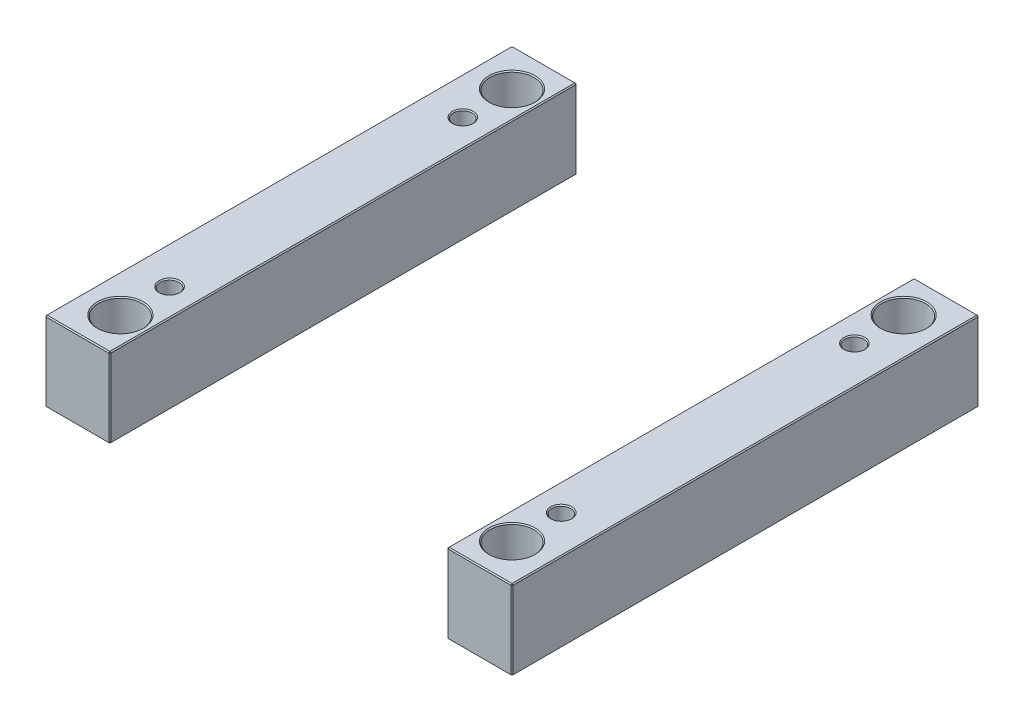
ISO-10303-21;
HEADER;
FILE_DESCRIPTION(('STEP AP214'),'2;1');
FILE_NAME('part.step','',(''),(''),'','','');
FILE_SCHEMA(('AUTOMOTIVE_DESIGN { 1 0 10303 214 1 1 1 1 }'));
ENDSEC;
DATA;
#1=APPLICATION_CONTEXT('core data for automotive mechanical design processes');
#2=APPLICATION_PROTOCOL_DEFINITION('international standard','automotive_design',2000,#1);
#3=PRODUCT_CONTEXT('',#1,'mechanical');
#4=PRODUCT('Part','Part','',(#3));
#5=PRODUCT_RELATED_PRODUCT_CATEGORY('part','',(#4));
#6=PRODUCT_DEFINITION_FORMATION('','',#4);
#7=PRODUCT_DEFINITION_CONTEXT('part definition',#1,'design');
#8=PRODUCT_DEFINITION('design','',#6,#7);
#9=PRODUCT_DEFINITION_SHAPE('','',#8);
#10=(LENGTH_UNIT() NAMED_UNIT(*) SI_UNIT(.MILLI.,.METRE.));
#11=(NAMED_UNIT(*) PLANE_ANGLE_UNIT() SI_UNIT($,.RADIAN.));
#12=(NAMED_UNIT(*) SI_UNIT($,.STERADIAN.) SOLID_ANGLE_UNIT());
#13=UNCERTAINTY_MEASURE_WITH_UNIT(LENGTH_MEASURE(1.E-05),#10,'distance_accuracy_value','');
#14=(GEOMETRIC_REPRESENTATION_CONTEXT(3) GLOBAL_UNCERTAINTY_ASSIGNED_CONTEXT((#13)) GLOBAL_UNIT_ASSIGNED_CONTEXT((#10,
#11,#12)) REPRESENTATION_CONTEXT('',''));
#15=CARTESIAN_POINT('',(0.,0.,0.));
#16=DIRECTION('',(0.,0.,1.));
#17=DIRECTION('',(1.,0.,0.));
#18=AXIS2_PLACEMENT_3D('',#15,#16,#17);
#19=CARTESIAN_POINT('',(-223.,76.,-223.));
#20=DIRECTION('',(0.,0.,1.));
#21=DIRECTION('',(1.,0.,0.));
#22=AXIS2_PLACEMENT_3D('',#19,#20,#21);
#23=PLANE('',#22);
#24=DIRECTION('',(-1.,0.,0.));
#25=VECTOR('',#24,1.);
#26=CARTESIAN_POINT('',(-223.,1.,-223.));
#27=LINE('',#26,#25);
#28=CARTESIAN_POINT('',(-162.,1.,-223.));
#29=VERTEX_POINT('',#28);
#30=CARTESIAN_POINT('',(-222.,1.,-223.));
#31=VERTEX_POINT('',#30);
#32=EDGE_CURVE('P0_E137',#29,#31,#27,.T.);
#33=ORIENTED_EDGE('',*,*,#32,.T.);
#34=DIRECTION('',(0.,1.,0.));
#35=VECTOR('',#34,1.);
#36=CARTESIAN_POINT('',(-222.,76.,-223.));
#37=LINE('',#36,#35);
#38=CARTESIAN_POINT('',(-222.,75.,-223.));
#39=VERTEX_POINT('',#38);
#40=EDGE_CURVE('P0_E265',#31,#39,#37,.T.);
#41=ORIENTED_EDGE('',*,*,#40,.T.);
#42=DIRECTION('',(1.,0.,0.));
#43=VECTOR('',#42,1.);
#44=CARTESIAN_POINT('',(-223.,75.,-223.));
#45=LINE('',#44,#43);
#46=CARTESIAN_POINT('',(-162.,75.,-223.));
#47=VERTEX_POINT('',#46);
#48=EDGE_CURVE('P0_E263',#39,#47,#45,.T.);
#49=ORIENTED_EDGE('',*,*,#48,.T.);
#50=DIRECTION('',(0.,-1.,0.));
#51=VECTOR('',#50,1.);
#52=CARTESIAN_POINT('',(-162.,76.,-223.));
#53=LINE('',#52,#51);
#54=EDGE_CURVE('P0_E260',#47,#29,#53,.T.);
#55=ORIENTED_EDGE('',*,*,#54,.T.);
#56=EDGE_LOOP('',(#33,#41,#49,#55));
#57=FACE_BOUND('',#56,.T.);
#58=ADVANCED_FACE('P0_F16',(#57),#23,.F.);
#59=CARTESIAN_POINT('',(-223.,76.,223.));
#60=DIRECTION('',(1.,0.,0.));
#61=DIRECTION('',(0.,0.,-1.));
#62=AXIS2_PLACEMENT_3D('',#59,#60,#61);
#63=PLANE('',#62);
#64=DIRECTION('',(0.,1.,0.));
#65=VECTOR('',#64,1.);
#66=CARTESIAN_POINT('',(-223.,76.,222.));
#67=LINE('',#66,#65);
#68=CARTESIAN_POINT('',(-223.,1.,222.));
#69=VERTEX_POINT('',#68);
#70=CARTESIAN_POINT('',(-223.,75.,222.));
#71=VERTEX_POINT('',#70);
#72=EDGE_CURVE('P0_E253',#69,#71,#67,.T.);
#73=ORIENTED_EDGE('',*,*,#72,.T.);
#74=DIRECTION('',(0.,0.,-1.));
#75=VECTOR('',#74,1.);
#76=CARTESIAN_POINT('',(-223.,75.,223.));
#77=LINE('',#76,#75);
#78=CARTESIAN_POINT('',(-223.,75.,-222.));
#79=VERTEX_POINT('',#78);
#80=EDGE_CURVE('P0_E258',#71,#79,#77,.T.);
#81=ORIENTED_EDGE('',*,*,#80,.T.);
#82=DIRECTION('',(0.,-1.,0.));
#83=VECTOR('',#82,1.);
#84=CARTESIAN_POINT('',(-223.,76.,-222.));
#85=LINE('',#84,#83);
#86=CARTESIAN_POINT('',(-223.,1.,-222.));
#87=VERTEX_POINT('',#86);
#88=EDGE_CURVE('P0_E255',#79,#87,#85,.T.);
#89=ORIENTED_EDGE('',*,*,#88,.T.);
#90=DIRECTION('',(0.,0.,1.));
#91=VECTOR('',#90,1.);
#92=CARTESIAN_POINT('',(-223.,1.,223.));
#93=LINE('',#92,#91);
#94=EDGE_CURVE('P0_E251',#87,#69,#93,.T.);
#95=ORIENTED_EDGE('',*,*,#94,.T.);
#96=EDGE_LOOP('',(#73,#81,#89,#95));
#97=FACE_BOUND('',#96,.T.);
#98=ADVANCED_FACE('P0_F333',(#97),#63,.F.);
#99=CARTESIAN_POINT('',(-223.,76.,223.));
#100=DIRECTION('',(0.,0.,-1.));
#101=DIRECTION('',(-1.,0.,0.));
#102=AXIS2_PLACEMENT_3D('',#99,#100,#101);
#103=PLANE('',#102);
#104=DIRECTION('',(-1.,0.,0.));
#105=VECTOR('',#104,1.);
#106=CARTESIAN_POINT('',(-223.,75.,223.));
#107=LINE('',#106,#105);
#108=CARTESIAN_POINT('',(-162.,75.,223.));
#109=VERTEX_POINT('',#108);
#110=CARTESIAN_POINT('',(-222.,75.,223.));
#111=VERTEX_POINT('',#110);
#112=EDGE_CURVE('P0_E272',#109,#111,#107,.T.);
#113=ORIENTED_EDGE('',*,*,#112,.T.);
#114=DIRECTION('',(0.,-1.,0.));
#115=VECTOR('',#114,1.);
#116=CARTESIAN_POINT('',(-222.,76.,223.));
#117=LINE('',#116,#115);
#118=CARTESIAN_POINT('',(-222.,1.,223.));
#119=VERTEX_POINT('',#118);
#120=EDGE_CURVE('P0_E274',#111,#119,#117,.T.);
#121=ORIENTED_EDGE('',*,*,#120,.T.);
#122=DIRECTION('',(1.,0.,0.));
#123=VECTOR('',#122,1.);
#124=CARTESIAN_POINT('',(-161.,1.,223.));
#125=LINE('',#124,#123);
#126=CARTESIAN_POINT('',(-162.,1.,223.));
#127=VERTEX_POINT('',#126);
#128=EDGE_CURVE('P0_E270',#119,#127,#125,.T.);
#129=ORIENTED_EDGE('',*,*,#128,.T.);
#130=DIRECTION('',(0.,1.,0.));
#131=VECTOR('',#130,1.);
#132=CARTESIAN_POINT('',(-162.,76.,223.));
#133=LINE('',#132,#131);
#134=EDGE_CURVE('P0_E268',#127,#109,#133,.T.);
#135=ORIENTED_EDGE('',*,*,#134,.T.);
#136=EDGE_LOOP('',(#113,#121,#129,#135));
#137=FACE_BOUND('',#136,.T.);
#138=ADVANCED_FACE('P0_F372',(#137),#103,.F.);
#139=CARTESIAN_POINT('',(-161.,76.,-223.));
#140=DIRECTION('',(-1.,0.,0.));
#141=DIRECTION('',(0.,0.,1.));
#142=AXIS2_PLACEMENT_3D('',#139,#140,#141);
#143=PLANE('',#142);
#144=DIRECTION('',(0.,0.,1.));
#145=VECTOR('',#144,1.);
#146=CARTESIAN_POINT('',(-161.,75.,-223.));
#147=LINE('',#146,#145);
#148=CARTESIAN_POINT('',(-161.,75.,-222.));
#149=VERTEX_POINT('',#148);
#150=CARTESIAN_POINT('',(-161.,75.,222.));
#151=VERTEX_POINT('',#150);
#152=EDGE_CURVE('P0_E31',#149,#151,#147,.T.);
#153=ORIENTED_EDGE('',*,*,#152,.T.);
#154=DIRECTION('',(0.,-1.,0.));
#155=VECTOR('',#154,1.);
#156=CARTESIAN_POINT('',(-161.,76.,222.));
#157=LINE('',#156,#155);
#158=CARTESIAN_POINT('',(-161.,1.,222.));
#159=VERTEX_POINT('',#158);
#160=EDGE_CURVE('P0_E190',#151,#159,#157,.T.);
#161=ORIENTED_EDGE('',*,*,#160,.T.);
#162=DIRECTION('',(0.,0.,-1.));
#163=VECTOR('',#162,1.);
#164=CARTESIAN_POINT('',(-161.,1.,-223.));
#165=LINE('',#164,#163);
#166=CARTESIAN_POINT('',(-161.,1.,-222.));
#167=VERTEX_POINT('',#166);
#168=EDGE_CURVE('P0_E286',#159,#167,#165,.T.);
#169=ORIENTED_EDGE('',*,*,#168,.T.);
#170=DIRECTION('',(0.,1.,0.));
#171=VECTOR('',#170,1.);
#172=CARTESIAN_POINT('',(-161.,76.,-222.));
#173=LINE('',#172,#171);
#174=EDGE_CURVE('P0_E36',#167,#149,#173,.T.);
#175=ORIENTED_EDGE('',*,*,#174,.T.);
#176=EDGE_LOOP('',(#153,#161,#169,#175));
#177=FACE_BOUND('',#176,.T.);
#178=ADVANCED_FACE('P0_F649',(#177),#143,.F.);
#179=CARTESIAN_POINT('',(0.,76.,0.));
#180=DIRECTION('',(0.,-1.,0.));
#181=DIRECTION('',(0.,0.,-1.));
#182=AXIS2_PLACEMENT_3D('',#179,#180,#181);
#183=PLANE('',#182);
#184=CARTESIAN_POINT('',(-187.,76.,-187.));
#185=DIRECTION('',(0.,-1.,0.));
#186=DIRECTION('',(0.,0.,-1.));
#187=AXIS2_PLACEMENT_3D('',#184,#185,#186);
#188=CIRCLE('',#187,22.);
#189=CARTESIAN_POINT('',(-187.,76.,-209.));
#190=VERTEX_POINT('',#189);
#191=EDGE_CURVE('P0_E214',#190,#190,#188,.T.);
#192=ORIENTED_EDGE('',*,*,#191,.T.);
#193=EDGE_LOOP('',(#192));
#194=FACE_BOUND('',#193,.T.);
#195=CARTESIAN_POINT('',(-187.,76.,187.));
#196=DIRECTION('',(0.,-1.,0.));
#197=DIRECTION('',(0.,0.,-1.));
#198=AXIS2_PLACEMENT_3D('',#195,#196,#197);
#199=CIRCLE('',#198,22.);
#200=CARTESIAN_POINT('',(-187.,76.,165.));
#201=VERTEX_POINT('',#200);
#202=EDGE_CURVE('P0_E211',#201,#201,#199,.T.);
#203=ORIENTED_EDGE('',*,*,#202,.T.);
#204=EDGE_LOOP('',(#203));
#205=FACE_BOUND('',#204,.T.);
#206=CARTESIAN_POINT('',(-187.,76.,140.));
#207=DIRECTION('',(0.,-1.,0.));
#208=DIRECTION('',(0.,0.,-1.));
#209=AXIS2_PLACEMENT_3D('',#206,#207,#208);
#210=CIRCLE('',#209,10.);
#211=CARTESIAN_POINT('',(-187.,76.,130.));
#212=VERTEX_POINT('',#211);
#213=EDGE_CURVE('P0_E193',#212,#212,#210,.T.);
#214=ORIENTED_EDGE('',*,*,#213,.T.);
#215=EDGE_LOOP('',(#214));
#216=FACE_BOUND('',#215,.T.);
#217=CARTESIAN_POINT('',(-187.,76.,-140.));
#218=DIRECTION('',(0.,-1.,0.));
#219=DIRECTION('',(0.,0.,-1.));
#220=AXIS2_PLACEMENT_3D('',#217,#218,#219);
#221=CIRCLE('',#220,10.);
#222=CARTESIAN_POINT('',(-187.,76.,-150.));
#223=VERTEX_POINT('',#222);
#224=EDGE_CURVE('P0_E189',#223,#223,#221,.T.);
#225=ORIENTED_EDGE('',*,*,#224,.T.);
#226=EDGE_LOOP('',(#225));
#227=FACE_BOUND('',#226,.T.);
#228=DIRECTION('',(0.,0.,1.));
#229=VECTOR('',#228,1.);
#230=CARTESIAN_POINT('',(-222.,76.,1.38155555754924E-13));
#231=LINE('',#230,#229);
#232=CARTESIAN_POINT('',(-222.,76.,-222.));
#233=VERTEX_POINT('',#232);
#234=CARTESIAN_POINT('',(-222.,76.,222.));
#235=VERTEX_POINT('',#234);
#236=EDGE_CURVE('P0_E281',#233,#235,#231,.T.);
#237=ORIENTED_EDGE('',*,*,#236,.T.);
#238=DIRECTION('',(1.,0.,0.));
#239=VECTOR('',#238,1.);
#240=CARTESIAN_POINT('',(-1.9876573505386E-13,76.,222.));
#241=LINE('',#240,#239);
#242=CARTESIAN_POINT('',(-162.,76.,222.));
#243=VERTEX_POINT('',#242);
#244=EDGE_CURVE('P0_E283',#235,#243,#241,.T.);
#245=ORIENTED_EDGE('',*,*,#244,.T.);
#246=DIRECTION('',(0.,0.,-1.));
#247=VECTOR('',#246,1.);
#248=CARTESIAN_POINT('',(-162.,76.,0.));
#249=LINE('',#248,#247);
#250=CARTESIAN_POINT('',(-162.,76.,-222.));
#251=VERTEX_POINT('',#250);
#252=EDGE_CURVE('P0_E277',#243,#251,#249,.T.);
#253=ORIENTED_EDGE('',*,*,#252,.T.);
#254=DIRECTION('',(-1.,0.,0.));
#255=VECTOR('',#254,1.);
#256=CARTESIAN_POINT('',(2.98148602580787E-13,76.,-222.));
#257=LINE('',#256,#255);
#258=EDGE_CURVE('P0_E279',#251,#233,#257,.T.);
#259=ORIENTED_EDGE('',*,*,#258,.T.);
#260=EDGE_LOOP('',(#237,#245,#253,#259));
#261=FACE_BOUND('',#260,.T.);
#262=ADVANCED_FACE('P0_F229',(#194,#205,#216,#227,#261),#183,.F.);
#263=CARTESIAN_POINT('',(0.,0.,0.));
#264=DIRECTION('',(0.,-1.,0.));
#265=DIRECTION('',(0.,0.,-1.));
#266=AXIS2_PLACEMENT_3D('',#263,#264,#265);
#267=PLANE('',#266);
#268=CARTESIAN_POINT('',(-187.,0.,-187.));
#269=DIRECTION('',(0.,-1.,0.));
#270=DIRECTION('',(0.,0.,-1.));
#271=AXIS2_PLACEMENT_3D('',#268,#269,#270);
#272=CIRCLE('',#271,22.);
#273=CARTESIAN_POINT('',(-187.,0.,-209.));
#274=VERTEX_POINT('',#273);
#275=EDGE_CURVE('P0_E202',#274,#274,#272,.F.);
#276=ORIENTED_EDGE('',*,*,#275,.T.);
#277=EDGE_LOOP('',(#276));
#278=FACE_BOUND('',#277,.T.);
#279=CARTESIAN_POINT('',(-187.,0.,187.));
#280=DIRECTION('',(0.,-1.,0.));
#281=DIRECTION('',(0.,0.,-1.));
#282=AXIS2_PLACEMENT_3D('',#279,#280,#281);
#283=CIRCLE('',#282,22.);
#284=CARTESIAN_POINT('',(-187.,0.,165.));
#285=VERTEX_POINT('',#284);
#286=EDGE_CURVE('P0_E199',#285,#285,#283,.F.);
#287=ORIENTED_EDGE('',*,*,#286,.T.);
#288=EDGE_LOOP('',(#287));
#289=FACE_BOUND('',#288,.T.);
#290=CARTESIAN_POINT('',(-187.,0.,-140.));
#291=DIRECTION('',(0.,-1.,0.));
#292=DIRECTION('',(0.,0.,-1.));
#293=AXIS2_PLACEMENT_3D('',#290,#291,#292);
#294=CIRCLE('',#293,10.);
#295=CARTESIAN_POINT('',(-187.,0.,-150.));
#296=VERTEX_POINT('',#295);
#297=EDGE_CURVE('P0_E235',#296,#296,#294,.F.);
#298=ORIENTED_EDGE('',*,*,#297,.T.);
#299=EDGE_LOOP('',(#298));
#300=FACE_BOUND('',#299,.T.);
#301=CARTESIAN_POINT('',(-187.,0.,140.));
#302=DIRECTION('',(0.,-1.,0.));
#303=DIRECTION('',(0.,0.,-1.));
#304=AXIS2_PLACEMENT_3D('',#301,#302,#303);
#305=CIRCLE('',#304,10.);
#306=CARTESIAN_POINT('',(-187.,0.,130.));
#307=VERTEX_POINT('',#306);
#308=EDGE_CURVE('P0_E238',#307,#307,#305,.F.);
#309=ORIENTED_EDGE('',*,*,#308,.T.);
#310=EDGE_LOOP('',(#309));
#311=FACE_BOUND('',#310,.T.);
#312=DIRECTION('',(-1.,0.,0.));
#313=VECTOR('',#312,1.);
#314=CARTESIAN_POINT('',(-223.,0.,222.));
#315=LINE('',#314,#313);
#316=CARTESIAN_POINT('',(-162.,0.,222.));
#317=VERTEX_POINT('',#316);
#318=CARTESIAN_POINT('',(-222.,0.,222.));
#319=VERTEX_POINT('',#318);
#320=EDGE_CURVE('P0_E114',#317,#319,#315,.T.);
#321=ORIENTED_EDGE('',*,*,#320,.T.);
#322=DIRECTION('',(0.,0.,-1.));
#323=VECTOR('',#322,1.);
#324=CARTESIAN_POINT('',(-222.,0.,-223.));
#325=LINE('',#324,#323);
#326=CARTESIAN_POINT('',(-222.,0.,-222.));
#327=VERTEX_POINT('',#326);
#328=EDGE_CURVE('P0_E110',#319,#327,#325,.T.);
#329=ORIENTED_EDGE('',*,*,#328,.T.);
#330=DIRECTION('',(1.,0.,0.));
#331=VECTOR('',#330,1.);
#332=CARTESIAN_POINT('',(-161.,0.,-222.));
#333=LINE('',#332,#331);
#334=CARTESIAN_POINT('',(-162.,0.,-222.));
#335=VERTEX_POINT('',#334);
#336=EDGE_CURVE('P0_E104',#327,#335,#333,.T.);
#337=ORIENTED_EDGE('',*,*,#336,.T.);
#338=DIRECTION('',(0.,0.,1.));
#339=VECTOR('',#338,1.);
#340=CARTESIAN_POINT('',(-162.,0.,223.));
#341=LINE('',#340,#339);
#342=EDGE_CURVE('P0_E107',#335,#317,#341,.T.);
#343=ORIENTED_EDGE('',*,*,#342,.T.);
#344=EDGE_LOOP('',(#321,#329,#337,#343));
#345=FACE_BOUND('',#344,.T.);
#346=ADVANCED_FACE('P0_F106',(#278,#289,#300,#311,#345),#267,.T.);
#347=CARTESIAN_POINT('',(-187.,0.,-140.));
#348=DIRECTION('',(0.,1.,0.));
#349=DIRECTION('',(0.,0.,1.));
#350=AXIS2_PLACEMENT_3D('',#347,#348,#349);
#351=CYLINDRICAL_SURFACE('',#350,9.);
#352=CARTESIAN_POINT('',(-187.,75.,-140.));
#353=DIRECTION('',(0.,-1.,0.));
#354=DIRECTION('',(0.,0.,-1.));
#355=AXIS2_PLACEMENT_3D('',#352,#353,#354);
#356=CIRCLE('',#355,9.);
#357=CARTESIAN_POINT('',(-187.,75.,-149.));
#358=VERTEX_POINT('',#357);
#359=EDGE_CURVE('P0_E196',#358,#358,#356,.F.);
#360=ORIENTED_EDGE('',*,*,#359,.T.);
#361=EDGE_LOOP('',(#360));
#362=FACE_BOUND('',#361,.T.);
#363=CARTESIAN_POINT('',(-187.,0.999999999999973,-140.));
#364=DIRECTION('',(0.,-1.,0.));
#365=DIRECTION('',(0.,0.,-1.));
#366=AXIS2_PLACEMENT_3D('',#363,#364,#365);
#367=CIRCLE('',#366,9.);
#368=CARTESIAN_POINT('',(-187.,0.999999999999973,-149.));
#369=VERTEX_POINT('',#368);
#370=EDGE_CURVE('P0_E241',#369,#369,#367,.T.);
#371=ORIENTED_EDGE('',*,*,#370,.T.);
#372=EDGE_LOOP('',(#371));
#373=FACE_BOUND('',#372,.T.);
#374=ADVANCED_FACE('P0_F228',(#362,#373),#351,.F.);
#375=CARTESIAN_POINT('',(-187.,0.,140.));
#376=DIRECTION('',(0.,1.,0.));
#377=DIRECTION('',(0.,0.,1.));
#378=AXIS2_PLACEMENT_3D('',#375,#376,#377);
#379=CYLINDRICAL_SURFACE('',#378,9.);
#380=CARTESIAN_POINT('',(-187.,75.,140.));
#381=DIRECTION('',(0.,-1.,0.));
#382=DIRECTION('',(0.,0.,-1.));
#383=AXIS2_PLACEMENT_3D('',#380,#381,#382);
#384=CIRCLE('',#383,9.);
#385=CARTESIAN_POINT('',(-187.,75.,131.));
#386=VERTEX_POINT('',#385);
#387=EDGE_CURVE('P0_E186',#386,#386,#384,.F.);
#388=ORIENTED_EDGE('',*,*,#387,.T.);
#389=EDGE_LOOP('',(#388));
#390=FACE_BOUND('',#389,.T.);
#391=CARTESIAN_POINT('',(-187.,0.999999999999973,140.));
#392=DIRECTION('',(0.,-1.,0.));
#393=DIRECTION('',(0.,0.,-1.));
#394=AXIS2_PLACEMENT_3D('',#391,#392,#393);
#395=CIRCLE('',#394,9.);
#396=CARTESIAN_POINT('',(-187.,0.999999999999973,131.));
#397=VERTEX_POINT('',#396);
#398=EDGE_CURVE('P0_E248',#397,#397,#395,.T.);
#399=ORIENTED_EDGE('',*,*,#398,.T.);
#400=EDGE_LOOP('',(#399));
#401=FACE_BOUND('',#400,.T.);
#402=ADVANCED_FACE('P0_F380',(#390,#401),#379,.F.);
#403=CARTESIAN_POINT('',(-187.,0.,-140.));
#404=DIRECTION('',(0.,-1.,0.));
#405=DIRECTION('',(0.,0.,-1.));
#406=AXIS2_PLACEMENT_3D('',#403,#404,#405);
#407=CONICAL_SURFACE('',#406,10.,0.785398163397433);
#408=ORIENTED_EDGE('',*,*,#370,.F.);
#409=EDGE_LOOP('',(#408));
#410=FACE_BOUND('',#409,.T.);
#411=ORIENTED_EDGE('',*,*,#297,.F.);
#412=EDGE_LOOP('',(#411));
#413=FACE_BOUND('',#412,.T.);
#414=ADVANCED_FACE('P0_F376',(#410,#413),#407,.F.);
#415=CARTESIAN_POINT('',(-187.,0.,140.));
#416=DIRECTION('',(0.,-1.,0.));
#417=DIRECTION('',(0.,0.,-1.));
#418=AXIS2_PLACEMENT_3D('',#415,#416,#417);
#419=CONICAL_SURFACE('',#418,10.,0.785398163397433);
#420=ORIENTED_EDGE('',*,*,#398,.F.);
#421=EDGE_LOOP('',(#420));
#422=FACE_BOUND('',#421,.T.);
#423=ORIENTED_EDGE('',*,*,#308,.F.);
#424=EDGE_LOOP('',(#423));
#425=FACE_BOUND('',#424,.T.);
#426=ADVANCED_FACE('P0_F379',(#422,#425),#419,.F.);
#427=CARTESIAN_POINT('',(-161.,76.,222.));
#428=DIRECTION('',(-0.707106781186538,0.,-0.707106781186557));
#429=DIRECTION('',(0.,-1.,0.));
#430=AXIS2_PLACEMENT_3D('',#427,#428,#429);
#431=PLANE('',#430);
#432=DIRECTION('',(-0.707106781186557,0.,0.707106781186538));
#433=VECTOR('',#432,1.);
#434=CARTESIAN_POINT('',(-161.5,75.,222.5));
#435=LINE('',#434,#433);
#436=EDGE_CURVE('P0_E125',#109,#151,#435,.F.);
#437=ORIENTED_EDGE('',*,*,#436,.F.);
#438=ORIENTED_EDGE('',*,*,#134,.F.);
#439=DIRECTION('',(0.707106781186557,0.,-0.707106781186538));
#440=VECTOR('',#439,1.);
#441=CARTESIAN_POINT('',(-162.,1.,223.));
#442=LINE('',#441,#440);
#443=EDGE_CURVE('P0_E181',#159,#127,#442,.F.);
#444=ORIENTED_EDGE('',*,*,#443,.F.);
#445=ORIENTED_EDGE('',*,*,#160,.F.);
#446=EDGE_LOOP('',(#437,#438,#444,#445));
#447=FACE_BOUND('',#446,.T.);
#448=ADVANCED_FACE('P0_F384',(#447),#431,.F.);
#449=CARTESIAN_POINT('',(-162.,76.,222.));
#450=DIRECTION('',(0.577350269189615,0.577350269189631,0.577350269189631));
#451=DIRECTION('',(0.,-0.707106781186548,0.707106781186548));
#452=AXIS2_PLACEMENT_3D('',#449,#450,#451);
#453=PLANE('',#452);
#454=DIRECTION('',(0.,0.707106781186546,-0.707106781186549));
#455=VECTOR('',#454,1.);
#456=CARTESIAN_POINT('',(-162.,76.,222.));
#457=LINE('',#456,#455);
#458=EDGE_CURVE('P0_E175',#109,#243,#457,.T.);
#459=ORIENTED_EDGE('',*,*,#458,.F.);
#460=ORIENTED_EDGE('',*,*,#436,.T.);
#461=DIRECTION('',(0.707106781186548,-0.707106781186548,0.));
#462=VECTOR('',#461,1.);
#463=CARTESIAN_POINT('',(-162.,76.,222.));
#464=LINE('',#463,#462);
#465=EDGE_CURVE('P0_E178',#243,#151,#464,.T.);
#466=ORIENTED_EDGE('',*,*,#465,.F.);
#467=EDGE_LOOP('',(#459,#460,#466));
#468=FACE_BOUND('',#467,.T.);
#469=ADVANCED_FACE('P0_F588',(#468),#453,.T.);
#470=CARTESIAN_POINT('',(-162.,1.,223.));
#471=DIRECTION('',(0.577350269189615,-0.577350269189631,0.577350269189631));
#472=DIRECTION('',(0.,-0.707106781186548,-0.707106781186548));
#473=AXIS2_PLACEMENT_3D('',#470,#471,#472);
#474=PLANE('',#473);
#475=DIRECTION('',(0.707106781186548,0.707106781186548,0.));
#476=VECTOR('',#475,1.);
#477=CARTESIAN_POINT('',(-161.5,0.500000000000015,222.));
#478=LINE('',#477,#476);
#479=EDGE_CURVE('P0_E123',#159,#317,#478,.F.);
#480=ORIENTED_EDGE('',*,*,#479,.F.);
#481=ORIENTED_EDGE('',*,*,#443,.T.);
#482=DIRECTION('',(0.,-0.707106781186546,-0.707106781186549));
#483=VECTOR('',#482,1.);
#484=CARTESIAN_POINT('',(-162.,1.,223.));
#485=LINE('',#484,#483);
#486=EDGE_CURVE('P0_E172',#317,#127,#485,.F.);
#487=ORIENTED_EDGE('',*,*,#486,.F.);
#488=EDGE_LOOP('',(#480,#481,#487));
#489=FACE_BOUND('',#488,.T.);
#490=ADVANCED_FACE('P0_F597',(#489),#474,.T.);
#491=CARTESIAN_POINT('',(-162.,76.,0.));
#492=DIRECTION('',(-0.707106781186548,-0.707106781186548,0.));
#493=DIRECTION('',(0.,0.,-1.));
#494=AXIS2_PLACEMENT_3D('',#491,#492,#493);
#495=PLANE('',#494);
#496=ORIENTED_EDGE('',*,*,#465,.T.);
#497=ORIENTED_EDGE('',*,*,#152,.F.);
#498=DIRECTION('',(-0.707106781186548,0.707106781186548,0.));
#499=VECTOR('',#498,1.);
#500=CARTESIAN_POINT('',(-161.5,75.5,-222.));
#501=LINE('',#500,#499);
#502=EDGE_CURVE('P0_E165',#251,#149,#501,.F.);
#503=ORIENTED_EDGE('',*,*,#502,.F.);
#504=ORIENTED_EDGE('',*,*,#252,.F.);
#505=EDGE_LOOP('',(#496,#497,#503,#504));
#506=FACE_BOUND('',#505,.T.);
#507=ADVANCED_FACE('P0_F349',(#506),#495,.F.);
#508=CARTESIAN_POINT('',(-1.9876573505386E-13,76.,222.));
#509=DIRECTION('',(0.,-0.707106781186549,-0.707106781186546));
#510=DIRECTION('',(1.,0.,0.));
#511=AXIS2_PLACEMENT_3D('',#508,#509,#510);
#512=PLANE('',#511);
#513=ORIENTED_EDGE('',*,*,#458,.T.);
#514=ORIENTED_EDGE('',*,*,#244,.F.);
#515=DIRECTION('',(0.,-0.707106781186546,0.707106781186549));
#516=VECTOR('',#515,1.);
#517=CARTESIAN_POINT('',(-222.,75.5,222.5));
#518=LINE('',#517,#516);
#519=EDGE_CURVE('P0_E162',#111,#235,#518,.F.);
#520=ORIENTED_EDGE('',*,*,#519,.F.);
#521=ORIENTED_EDGE('',*,*,#112,.F.);
#522=EDGE_LOOP('',(#513,#514,#520,#521));
#523=FACE_BOUND('',#522,.T.);
#524=ADVANCED_FACE('P0_F344',(#523),#512,.F.);
#525=CARTESIAN_POINT('',(-222.,76.,223.));
#526=DIRECTION('',(0.707106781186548,0.,-0.707106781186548));
#527=DIRECTION('',(0.,-1.,0.));
#528=AXIS2_PLACEMENT_3D('',#525,#526,#527);
#529=PLANE('',#528);
#530=DIRECTION('',(0.707106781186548,0.,0.707106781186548));
#531=VECTOR('',#530,1.);
#532=CARTESIAN_POINT('',(-222.,1.,223.));
#533=LINE('',#532,#531);
#534=EDGE_CURVE('P0_E156',#119,#69,#533,.F.);
#535=ORIENTED_EDGE('',*,*,#534,.F.);
#536=ORIENTED_EDGE('',*,*,#120,.F.);
#537=DIRECTION('',(-0.707106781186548,0.,-0.707106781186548));
#538=VECTOR('',#537,1.);
#539=CARTESIAN_POINT('',(-223.,75.,222.));
#540=LINE('',#539,#538);
#541=EDGE_CURVE('P0_E159',#71,#111,#540,.F.);
#542=ORIENTED_EDGE('',*,*,#541,.F.);
#543=ORIENTED_EDGE('',*,*,#72,.F.);
#544=EDGE_LOOP('',(#535,#536,#542,#543));
#545=FACE_BOUND('',#544,.T.);
#546=ADVANCED_FACE('P0_F338',(#545),#529,.F.);
#547=CARTESIAN_POINT('',(-223.,1.,223.));
#548=DIRECTION('',(0.,-0.707106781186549,0.707106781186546));
#549=DIRECTION('',(-1.,0.,0.));
#550=AXIS2_PLACEMENT_3D('',#547,#548,#549);
#551=PLANE('',#550);
#552=ORIENTED_EDGE('',*,*,#486,.T.);
#553=ORIENTED_EDGE('',*,*,#128,.F.);
#554=DIRECTION('',(0.,0.707106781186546,0.707106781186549));
#555=VECTOR('',#554,1.);
#556=CARTESIAN_POINT('',(-222.,1.,223.));
#557=LINE('',#556,#555);
#558=EDGE_CURVE('P0_E134',#319,#119,#557,.T.);
#559=ORIENTED_EDGE('',*,*,#558,.F.);
#560=ORIENTED_EDGE('',*,*,#320,.F.);
#561=EDGE_LOOP('',(#552,#553,#559,#560));
#562=FACE_BOUND('',#561,.T.);
#563=ADVANCED_FACE('P0_F364',(#562),#551,.T.);
#564=CARTESIAN_POINT('',(-161.,1.,-223.));
#565=DIRECTION('',(0.707106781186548,-0.707106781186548,0.));
#566=DIRECTION('',(0.,0.,1.));
#567=AXIS2_PLACEMENT_3D('',#564,#565,#566);
#568=PLANE('',#567);
#569=ORIENTED_EDGE('',*,*,#479,.T.);
#570=ORIENTED_EDGE('',*,*,#342,.F.);
#571=DIRECTION('',(-0.707106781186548,-0.707106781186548,0.));
#572=VECTOR('',#571,1.);
#573=CARTESIAN_POINT('',(-162.,0.,-222.));
#574=LINE('',#573,#572);
#575=EDGE_CURVE('P0_E120',#167,#335,#574,.T.);
#576=ORIENTED_EDGE('',*,*,#575,.F.);
#577=ORIENTED_EDGE('',*,*,#168,.F.);
#578=EDGE_LOOP('',(#569,#570,#576,#577));
#579=FACE_BOUND('',#578,.T.);
#580=ADVANCED_FACE('P0_F119',(#579),#568,.T.);
#581=CARTESIAN_POINT('',(-162.,76.,-223.));
#582=DIRECTION('',(-0.707106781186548,0.,0.707106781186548));
#583=DIRECTION('',(0.,-1.,0.));
#584=AXIS2_PLACEMENT_3D('',#581,#582,#583);
#585=PLANE('',#584);
#586=DIRECTION('',(0.707106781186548,0.,0.707106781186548));
#587=VECTOR('',#586,1.);
#588=CARTESIAN_POINT('',(-162.,75.,-223.));
#589=LINE('',#588,#587);
#590=EDGE_CURVE('P0_E168',#149,#47,#589,.F.);
#591=ORIENTED_EDGE('',*,*,#590,.F.);
#592=ORIENTED_EDGE('',*,*,#174,.F.);
#593=DIRECTION('',(-0.707106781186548,0.,-0.707106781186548));
#594=VECTOR('',#593,1.);
#595=CARTESIAN_POINT('',(-161.5,1.,-222.5));
#596=LINE('',#595,#594);
#597=EDGE_CURVE('P0_E133',#29,#167,#596,.F.);
#598=ORIENTED_EDGE('',*,*,#597,.F.);
#599=ORIENTED_EDGE('',*,*,#54,.F.);
#600=EDGE_LOOP('',(#591,#592,#598,#599));
#601=FACE_BOUND('',#600,.T.);
#602=ADVANCED_FACE('P0_F354',(#601),#585,.F.);
#603=CARTESIAN_POINT('',(-162.,75.,-223.));
#604=DIRECTION('',(0.577350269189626,0.577350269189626,-0.577350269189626));
#605=DIRECTION('',(-0.707106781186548,0.,-0.707106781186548));
#606=AXIS2_PLACEMENT_3D('',#603,#604,#605);
#607=PLANE('',#606);
#608=ORIENTED_EDGE('',*,*,#502,.T.);
#609=ORIENTED_EDGE('',*,*,#590,.T.);
#610=DIRECTION('',(0.,-0.707106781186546,-0.70710678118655));
#611=VECTOR('',#610,1.);
#612=CARTESIAN_POINT('',(-162.,75.,-223.));
#613=LINE('',#612,#611);
#614=EDGE_CURVE('P0_E151',#251,#47,#613,.T.);
#615=ORIENTED_EDGE('',*,*,#614,.F.);
#616=EDGE_LOOP('',(#608,#609,#615));
#617=FACE_BOUND('',#616,.T.);
#618=ADVANCED_FACE('P0_F352',(#617),#607,.T.);
#619=CARTESIAN_POINT('',(-223.,75.,222.));
#620=DIRECTION('',(-0.577350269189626,0.577350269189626,0.577350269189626));
#621=DIRECTION('',(0.707106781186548,0.,0.707106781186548));
#622=AXIS2_PLACEMENT_3D('',#619,#620,#621);
#623=PLANE('',#622);
#624=ORIENTED_EDGE('',*,*,#541,.T.);
#625=ORIENTED_EDGE('',*,*,#519,.T.);
#626=DIRECTION('',(0.707106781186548,0.707106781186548,0.));
#627=VECTOR('',#626,1.);
#628=CARTESIAN_POINT('',(-223.,75.,222.));
#629=LINE('',#628,#627);
#630=EDGE_CURVE('P0_E142',#71,#235,#629,.T.);
#631=ORIENTED_EDGE('',*,*,#630,.F.);
#632=EDGE_LOOP('',(#624,#625,#631));
#633=FACE_BOUND('',#632,.T.);
#634=ADVANCED_FACE('P0_F341',(#633),#623,.T.);
#635=CARTESIAN_POINT('',(-222.,1.,223.));
#636=DIRECTION('',(-0.577350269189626,-0.577350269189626,0.577350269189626));
#637=DIRECTION('',(0.707106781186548,0.,0.707106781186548));
#638=AXIS2_PLACEMENT_3D('',#635,#636,#637);
#639=PLANE('',#638);
#640=ORIENTED_EDGE('',*,*,#558,.T.);
#641=ORIENTED_EDGE('',*,*,#534,.T.);
#642=DIRECTION('',(0.707106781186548,-0.707106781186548,0.));
#643=VECTOR('',#642,1.);
#644=CARTESIAN_POINT('',(-222.5,0.5,222.));
#645=LINE('',#644,#643);
#646=EDGE_CURVE('P0_E138',#319,#69,#645,.F.);
#647=ORIENTED_EDGE('',*,*,#646,.F.);
#648=EDGE_LOOP('',(#640,#641,#647));
#649=FACE_BOUND('',#648,.T.);
#650=ADVANCED_FACE('P0_F403',(#649),#639,.T.);
#651=CARTESIAN_POINT('',(-162.,0.,-222.));
#652=DIRECTION('',(0.577350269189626,-0.577350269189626,-0.577350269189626));
#653=DIRECTION('',(-0.707106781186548,0.,-0.707106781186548));
#654=AXIS2_PLACEMENT_3D('',#651,#652,#653);
#655=PLANE('',#654);
#656=ORIENTED_EDGE('',*,*,#597,.T.);
#657=ORIENTED_EDGE('',*,*,#575,.T.);
#658=DIRECTION('',(0.,0.707106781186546,-0.70710678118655));
#659=VECTOR('',#658,1.);
#660=CARTESIAN_POINT('',(-162.,0.,-222.));
#661=LINE('',#660,#659);
#662=EDGE_CURVE('P0_E130',#29,#335,#661,.F.);
#663=ORIENTED_EDGE('',*,*,#662,.F.);
#664=EDGE_LOOP('',(#656,#657,#663));
#665=FACE_BOUND('',#664,.T.);
#666=ADVANCED_FACE('P0_F129',(#665),#655,.T.);
#667=CARTESIAN_POINT('',(2.98148602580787E-13,76.,-222.));
#668=DIRECTION('',(0.,-0.70710678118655,0.707106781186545));
#669=DIRECTION('',(-1.,0.,0.));
#670=AXIS2_PLACEMENT_3D('',#667,#668,#669);
#671=PLANE('',#670);
#672=ORIENTED_EDGE('',*,*,#614,.T.);
#673=ORIENTED_EDGE('',*,*,#48,.F.);
#674=DIRECTION('',(0.,0.707106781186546,0.707106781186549));
#675=VECTOR('',#674,1.);
#676=CARTESIAN_POINT('',(-222.,75.,-223.));
#677=LINE('',#676,#675);
#678=EDGE_CURVE('P0_E139',#233,#39,#677,.F.);
#679=ORIENTED_EDGE('',*,*,#678,.F.);
#680=ORIENTED_EDGE('',*,*,#258,.F.);
#681=EDGE_LOOP('',(#672,#673,#679,#680));
#682=FACE_BOUND('',#681,.T.);
#683=ADVANCED_FACE('P0_F316',(#682),#671,.F.);
#684=CARTESIAN_POINT('',(-222.,76.,1.38155555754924E-13));
#685=DIRECTION('',(0.707106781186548,-0.707106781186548,0.));
#686=DIRECTION('',(0.,0.,1.));
#687=AXIS2_PLACEMENT_3D('',#684,#685,#686);
#688=PLANE('',#687);
#689=ORIENTED_EDGE('',*,*,#630,.T.);
#690=ORIENTED_EDGE('',*,*,#236,.F.);
#691=DIRECTION('',(-0.707106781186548,-0.707106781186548,0.));
#692=VECTOR('',#691,1.);
#693=CARTESIAN_POINT('',(-222.5,75.5,-222.));
#694=LINE('',#693,#692);
#695=EDGE_CURVE('P0_E145',#79,#233,#694,.F.);
#696=ORIENTED_EDGE('',*,*,#695,.F.);
#697=ORIENTED_EDGE('',*,*,#80,.F.);
#698=EDGE_LOOP('',(#689,#690,#696,#697));
#699=FACE_BOUND('',#698,.T.);
#700=ADVANCED_FACE('P0_F310',(#699),#688,.F.);
#701=CARTESIAN_POINT('',(-223.,1.,223.));
#702=DIRECTION('',(-0.707106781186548,-0.707106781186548,0.));
#703=DIRECTION('',(0.,0.,-1.));
#704=AXIS2_PLACEMENT_3D('',#701,#702,#703);
#705=PLANE('',#704);
#706=ORIENTED_EDGE('',*,*,#646,.T.);
#707=ORIENTED_EDGE('',*,*,#94,.F.);
#708=DIRECTION('',(-0.707106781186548,0.707106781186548,0.));
#709=VECTOR('',#708,1.);
#710=CARTESIAN_POINT('',(-223.,1.,-222.));
#711=LINE('',#710,#709);
#712=EDGE_CURVE('P0_E297',#327,#87,#711,.T.);
#713=ORIENTED_EDGE('',*,*,#712,.F.);
#714=ORIENTED_EDGE('',*,*,#328,.F.);
#715=EDGE_LOOP('',(#706,#707,#713,#714));
#716=FACE_BOUND('',#715,.T.);
#717=ADVANCED_FACE('P0_F329',(#716),#705,.T.);
#718=CARTESIAN_POINT('',(-223.,1.,-223.));
#719=DIRECTION('',(0.,-0.70710678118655,-0.707106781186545));
#720=DIRECTION('',(1.,0.,0.));
#721=AXIS2_PLACEMENT_3D('',#718,#719,#720);
#722=PLANE('',#721);
#723=ORIENTED_EDGE('',*,*,#662,.T.);
#724=ORIENTED_EDGE('',*,*,#336,.F.);
#725=DIRECTION('',(0.,-0.707106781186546,0.707106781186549));
#726=VECTOR('',#725,1.);
#727=CARTESIAN_POINT('',(-222.,0.5,-222.5));
#728=LINE('',#727,#726);
#729=EDGE_CURVE('P0_E295',#31,#327,#728,.T.);
#730=ORIENTED_EDGE('',*,*,#729,.F.);
#731=ORIENTED_EDGE('',*,*,#32,.F.);
#732=EDGE_LOOP('',(#723,#724,#730,#731));
#733=FACE_BOUND('',#732,.T.);
#734=ADVANCED_FACE('P0_F136',(#733),#722,.T.);
#735=CARTESIAN_POINT('',(-222.,75.,-223.));
#736=DIRECTION('',(-0.577350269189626,0.577350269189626,-0.577350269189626));
#737=DIRECTION('',(-0.707106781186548,0.,0.707106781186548));
#738=AXIS2_PLACEMENT_3D('',#735,#736,#737);
#739=PLANE('',#738);
#740=ORIENTED_EDGE('',*,*,#695,.T.);
#741=ORIENTED_EDGE('',*,*,#678,.T.);
#742=DIRECTION('',(0.707106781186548,0.,-0.707106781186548));
#743=VECTOR('',#742,1.);
#744=CARTESIAN_POINT('',(-222.,75.,-223.));
#745=LINE('',#744,#743);
#746=EDGE_CURVE('P0_E293',#79,#39,#745,.T.);
#747=ORIENTED_EDGE('',*,*,#746,.F.);
#748=EDGE_LOOP('',(#740,#741,#747));
#749=FACE_BOUND('',#748,.T.);
#750=ADVANCED_FACE('P0_F303',(#749),#739,.T.);
#751=CARTESIAN_POINT('',(-223.,1.,-222.));
#752=DIRECTION('',(-0.577350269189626,-0.577350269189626,-0.577350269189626));
#753=DIRECTION('',(-0.707106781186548,0.,0.707106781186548));
#754=AXIS2_PLACEMENT_3D('',#751,#752,#753);
#755=PLANE('',#754);
#756=ORIENTED_EDGE('',*,*,#729,.T.);
#757=ORIENTED_EDGE('',*,*,#712,.T.);
#758=DIRECTION('',(-0.707106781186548,0.,0.707106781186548));
#759=VECTOR('',#758,1.);
#760=CARTESIAN_POINT('',(-223.,1.,-222.));
#761=LINE('',#760,#759);
#762=EDGE_CURVE('P0_E291',#31,#87,#761,.T.);
#763=ORIENTED_EDGE('',*,*,#762,.F.);
#764=EDGE_LOOP('',(#756,#757,#763));
#765=FACE_BOUND('',#764,.T.);
#766=ADVANCED_FACE('P0_F325',(#765),#755,.T.);
#767=CARTESIAN_POINT('',(-223.,76.,-222.));
#768=DIRECTION('',(0.707106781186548,0.,0.707106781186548));
#769=DIRECTION('',(0.,-1.,0.));
#770=AXIS2_PLACEMENT_3D('',#767,#768,#769);
#771=PLANE('',#770);
#772=ORIENTED_EDGE('',*,*,#746,.T.);
#773=ORIENTED_EDGE('',*,*,#40,.F.);
#774=ORIENTED_EDGE('',*,*,#762,.T.);
#775=ORIENTED_EDGE('',*,*,#88,.F.);
#776=EDGE_LOOP('',(#772,#773,#774,#775));
#777=FACE_BOUND('',#776,.T.);
#778=ADVANCED_FACE('P0_F323',(#777),#771,.F.);
#779=CARTESIAN_POINT('',(-187.,75.,140.));
#780=DIRECTION('',(0.,1.,0.));
#781=DIRECTION('',(0.,0.,1.));
#782=AXIS2_PLACEMENT_3D('',#779,#780,#781);
#783=CONICAL_SURFACE('',#782,9.,0.78539816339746);
#784=ORIENTED_EDGE('',*,*,#213,.F.);
#785=EDGE_LOOP('',(#784));
#786=FACE_BOUND('',#785,.T.);
#787=ORIENTED_EDGE('',*,*,#387,.F.);
#788=EDGE_LOOP('',(#787));
#789=FACE_BOUND('',#788,.T.);
#790=ADVANCED_FACE('P0_F388',(#786,#789),#783,.F.);
#791=CARTESIAN_POINT('',(-187.,75.,-140.));
#792=DIRECTION('',(0.,1.,0.));
#793=DIRECTION('',(0.,0.,1.));
#794=AXIS2_PLACEMENT_3D('',#791,#792,#793);
#795=CONICAL_SURFACE('',#794,9.,0.78539816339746);
#796=ORIENTED_EDGE('',*,*,#224,.F.);
#797=EDGE_LOOP('',(#796));
#798=FACE_BOUND('',#797,.T.);
#799=ORIENTED_EDGE('',*,*,#359,.F.);
#800=EDGE_LOOP('',(#799));
#801=FACE_BOUND('',#800,.T.);
#802=ADVANCED_FACE('P0_F470',(#798,#801),#795,.F.);
#803=CARTESIAN_POINT('',(-187.,0.,187.));
#804=DIRECTION('',(0.,1.,0.));
#805=DIRECTION('',(0.,0.,1.));
#806=AXIS2_PLACEMENT_3D('',#803,#804,#805);
#807=CYLINDRICAL_SURFACE('',#806,21.);
#808=CARTESIAN_POINT('',(-187.,75.,187.));
#809=DIRECTION('',(0.,-1.,0.));
#810=DIRECTION('',(0.,0.,-1.));
#811=AXIS2_PLACEMENT_3D('',#808,#809,#810);
#812=CIRCLE('',#811,21.);
#813=CARTESIAN_POINT('',(-187.,75.,166.));
#814=VERTEX_POINT('',#813);
#815=EDGE_CURVE('P0_E10',#814,#814,#812,.F.);
#816=ORIENTED_EDGE('',*,*,#815,.T.);
#817=EDGE_LOOP('',(#816));
#818=FACE_BOUND('',#817,.T.);
#819=CARTESIAN_POINT('',(-187.,0.999999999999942,187.));
#820=DIRECTION('',(0.,-1.,0.));
#821=DIRECTION('',(0.,0.,-1.));
#822=AXIS2_PLACEMENT_3D('',#819,#820,#821);
#823=CIRCLE('',#822,21.);
#824=CARTESIAN_POINT('',(-187.,0.999999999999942,166.));
#825=VERTEX_POINT('',#824);
#826=EDGE_CURVE('P0_E24',#825,#825,#823,.T.);
#827=ORIENTED_EDGE('',*,*,#826,.T.);
#828=EDGE_LOOP('',(#827));
#829=FACE_BOUND('',#828,.T.);
#830=ADVANCED_FACE('P0_F219',(#818,#829),#807,.F.);
#831=CARTESIAN_POINT('',(-187.,0.,-187.));
#832=DIRECTION('',(0.,1.,0.));
#833=DIRECTION('',(0.,0.,1.));
#834=AXIS2_PLACEMENT_3D('',#831,#832,#833);
#835=CYLINDRICAL_SURFACE('',#834,21.);
#836=CARTESIAN_POINT('',(-187.,1.,-187.));
#837=DIRECTION('',(0.,-1.,0.));
#838=DIRECTION('',(0.,0.,-1.));
#839=AXIS2_PLACEMENT_3D('',#836,#837,#838);
#840=CIRCLE('',#839,21.);
#841=CARTESIAN_POINT('',(-187.,1.,-208.));
#842=VERTEX_POINT('',#841);
#843=EDGE_CURVE('P0_E208',#842,#842,#840,.T.);
#844=ORIENTED_EDGE('',*,*,#843,.T.);
#845=EDGE_LOOP('',(#844));
#846=FACE_BOUND('',#845,.T.);
#847=CARTESIAN_POINT('',(-187.,75.,-187.));
#848=DIRECTION('',(0.,-1.,0.));
#849=DIRECTION('',(0.,0.,-1.));
#850=AXIS2_PLACEMENT_3D('',#847,#848,#849);
#851=CIRCLE('',#850,21.);
#852=CARTESIAN_POINT('',(-187.,75.,-208.));
#853=VERTEX_POINT('',#852);
#854=EDGE_CURVE('P0_E205',#853,#853,#851,.F.);
#855=ORIENTED_EDGE('',*,*,#854,.T.);
#856=EDGE_LOOP('',(#855));
#857=FACE_BOUND('',#856,.T.);
#858=ADVANCED_FACE('P0_F487',(#846,#857),#835,.F.);
#859=CARTESIAN_POINT('',(-187.,0.,-187.));
#860=DIRECTION('',(0.,-1.,0.));
#861=DIRECTION('',(0.,0.,-1.));
#862=AXIS2_PLACEMENT_3D('',#859,#860,#861);
#863=CONICAL_SURFACE('',#862,22.,0.785398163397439);
#864=ORIENTED_EDGE('',*,*,#843,.F.);
#865=EDGE_LOOP('',(#864));
#866=FACE_BOUND('',#865,.T.);
#867=ORIENTED_EDGE('',*,*,#275,.F.);
#868=EDGE_LOOP('',(#867));
#869=FACE_BOUND('',#868,.T.);
#870=ADVANCED_FACE('P0_F496',(#866,#869),#863,.F.);
#871=CARTESIAN_POINT('',(-187.,75.,-187.));
#872=DIRECTION('',(0.,1.,0.));
#873=DIRECTION('',(0.,0.,1.));
#874=AXIS2_PLACEMENT_3D('',#871,#872,#873);
#875=CONICAL_SURFACE('',#874,21.,0.785398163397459);
#876=ORIENTED_EDGE('',*,*,#191,.F.);
#877=EDGE_LOOP('',(#876));
#878=FACE_BOUND('',#877,.T.);
#879=ORIENTED_EDGE('',*,*,#854,.F.);
#880=EDGE_LOOP('',(#879));
#881=FACE_BOUND('',#880,.T.);
#882=ADVANCED_FACE('P0_F505',(#878,#881),#875,.F.);
#883=CARTESIAN_POINT('',(-187.,75.,187.));
#884=DIRECTION('',(0.,1.,0.));
#885=DIRECTION('',(0.,0.,1.));
#886=AXIS2_PLACEMENT_3D('',#883,#884,#885);
#887=CONICAL_SURFACE('',#886,21.,0.785398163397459);
#888=ORIENTED_EDGE('',*,*,#202,.F.);
#889=EDGE_LOOP('',(#888));
#890=FACE_BOUND('',#889,.T.);
#891=ORIENTED_EDGE('',*,*,#815,.F.);
#892=EDGE_LOOP('',(#891));
#893=FACE_BOUND('',#892,.T.);
#894=ADVANCED_FACE('P0_F223',(#890,#893),#887,.F.);
#895=CARTESIAN_POINT('',(-187.,0.,187.));
#896=DIRECTION('',(0.,-1.,0.));
#897=DIRECTION('',(0.,0.,-1.));
#898=AXIS2_PLACEMENT_3D('',#895,#896,#897);
#899=CONICAL_SURFACE('',#898,22.,0.785398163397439);
#900=ORIENTED_EDGE('',*,*,#826,.F.);
#901=EDGE_LOOP('',(#900));
#902=FACE_BOUND('',#901,.T.);
#903=ORIENTED_EDGE('',*,*,#286,.F.);
#904=EDGE_LOOP('',(#903));
#905=FACE_BOUND('',#904,.T.);
#906=ADVANCED_FACE('P0_F18',(#902,#905),#899,.F.);
#907=CLOSED_SHELL('',(#58,#98,#138,#178,#262,#346,#374,#402,#414,#426,#448,#469,#490,#507,#524,
#546,#563,#580,#602,#618,#634,#650,#666,#683,#700,#717,#734,#750,#766,#778,#790,#802,#830,#858,
#870,#882,#894,#906));
#908=MANIFOLD_SOLID_BREP('P0_B1',#907);
#909=CARTESIAN_POINT('',(223.,76.,223.));
#910=DIRECTION('',(0.,0.,-1.));
#911=DIRECTION('',(-1.,0.,0.));
#912=AXIS2_PLACEMENT_3D('',#909,#910,#911);
#913=PLANE('',#912);
#914=DIRECTION('',(0.,-1.,0.));
#915=VECTOR('',#914,1.);
#916=CARTESIAN_POINT('',(162.,76.,223.));
#917=LINE('',#916,#915);
#918=CARTESIAN_POINT('',(162.,75.,223.));
#919=VERTEX_POINT('',#918);
#920=CARTESIAN_POINT('',(162.,1.,223.));
#921=VERTEX_POINT('',#920);
#922=EDGE_CURVE('P1_E175',#919,#921,#917,.T.);
#923=ORIENTED_EDGE('',*,*,#922,.T.);
#924=DIRECTION('',(1.,0.,0.));
#925=VECTOR('',#924,1.);
#926=CARTESIAN_POINT('',(223.,1.,223.));
#927=LINE('',#926,#925);
#928=CARTESIAN_POINT('',(222.,1.,223.));
#929=VERTEX_POINT('',#928);
#930=EDGE_CURVE('P1_E177',#921,#929,#927,.T.);
#931=ORIENTED_EDGE('',*,*,#930,.T.);
#932=DIRECTION('',(0.,1.,0.));
#933=VECTOR('',#932,1.);
#934=CARTESIAN_POINT('',(222.,76.,223.));
#935=LINE('',#934,#933);
#936=CARTESIAN_POINT('',(222.,75.,223.));
#937=VERTEX_POINT('',#936);
#938=EDGE_CURVE('P1_E173',#929,#937,#935,.T.);
#939=ORIENTED_EDGE('',*,*,#938,.T.);
#940=DIRECTION('',(-1.,0.,0.));
#941=VECTOR('',#940,1.);
#942=CARTESIAN_POINT('',(161.,75.,223.));
#943=LINE('',#942,#941);
#944=EDGE_CURVE('P1_E171',#937,#919,#943,.T.);
#945=ORIENTED_EDGE('',*,*,#944,.T.);
#946=EDGE_LOOP('',(#923,#931,#939,#945));
#947=FACE_BOUND('',#946,.T.);
#948=ADVANCED_FACE('P1_F17',(#947),#913,.F.);
#949=CARTESIAN_POINT('',(223.,76.,223.));
#950=DIRECTION('',(-1.,0.,0.));
#951=DIRECTION('',(0.,0.,1.));
#952=AXIS2_PLACEMENT_3D('',#949,#950,#951);
#953=PLANE('',#952);
#954=DIRECTION('',(0.,0.,1.));
#955=VECTOR('',#954,1.);
#956=CARTESIAN_POINT('',(223.,75.,223.));
#957=LINE('',#956,#955);
#958=CARTESIAN_POINT('',(223.,75.,-222.));
#959=VERTEX_POINT('',#958);
#960=CARTESIAN_POINT('',(223.,75.,222.));
#961=VERTEX_POINT('',#960);
#962=EDGE_CURVE('P1_E189',#959,#961,#957,.T.);
#963=ORIENTED_EDGE('',*,*,#962,.T.);
#964=DIRECTION('',(0.,-1.,0.));
#965=VECTOR('',#964,1.);
#966=CARTESIAN_POINT('',(223.,76.,222.));
#967=LINE('',#966,#965);
#968=CARTESIAN_POINT('',(223.,1.,222.));
#969=VERTEX_POINT('',#968);
#970=EDGE_CURVE('P1_E195',#961,#969,#967,.T.);
#971=ORIENTED_EDGE('',*,*,#970,.T.);
#972=DIRECTION('',(0.,0.,-1.));
#973=VECTOR('',#972,1.);
#974=CARTESIAN_POINT('',(223.,1.,223.));
#975=LINE('',#974,#973);
#976=CARTESIAN_POINT('',(223.,1.,-222.));
#977=VERTEX_POINT('',#976);
#978=EDGE_CURVE('P1_E193',#969,#977,#975,.T.);
#979=ORIENTED_EDGE('',*,*,#978,.T.);
#980=DIRECTION('',(0.,1.,0.));
#981=VECTOR('',#980,1.);
#982=CARTESIAN_POINT('',(223.,76.,-222.));
#983=LINE('',#982,#981);
#984=EDGE_CURVE('P1_E191',#977,#959,#983,.T.);
#985=ORIENTED_EDGE('',*,*,#984,.T.);
#986=EDGE_LOOP('',(#963,#971,#979,#985));
#987=FACE_BOUND('',#986,.T.);
#988=ADVANCED_FACE('P1_F322',(#987),#953,.F.);
#989=CARTESIAN_POINT('',(223.,76.,-223.));
#990=DIRECTION('',(0.,0.,1.));
#991=DIRECTION('',(1.,0.,0.));
#992=AXIS2_PLACEMENT_3D('',#989,#990,#991);
#993=PLANE('',#992);
#994=DIRECTION('',(0.,-1.,0.));
#995=VECTOR('',#994,1.);
#996=CARTESIAN_POINT('',(222.,76.,-223.));
#997=LINE('',#996,#995);
#998=CARTESIAN_POINT('',(222.,75.,-223.));
#999=VERTEX_POINT('',#998);
#1000=CARTESIAN_POINT('',(222.,1.,-223.));
#1001=VERTEX_POINT('',#1000);
#1002=EDGE_CURVE('P1_E166',#999,#1001,#997,.T.);
#1003=ORIENTED_EDGE('',*,*,#1002,.T.);
#1004=DIRECTION('',(-1.,0.,0.));
#1005=VECTOR('',#1004,1.);
#1006=CARTESIAN_POINT('',(223.,1.,-223.));
#1007=LINE('',#1006,#1005);
#1008=CARTESIAN_POINT('',(162.,1.,-223.));
#1009=VERTEX_POINT('',#1008);
#1010=EDGE_CURVE('P1_E113',#1001,#1009,#1007,.T.);
#1011=ORIENTED_EDGE('',*,*,#1010,.T.);
#1012=DIRECTION('',(0.,1.,0.));
#1013=VECTOR('',#1012,1.);
#1014=CARTESIAN_POINT('',(162.,76.,-223.));
#1015=LINE('',#1014,#1013);
#1016=CARTESIAN_POINT('',(162.,75.,-223.));
#1017=VERTEX_POINT('',#1016);
#1018=EDGE_CURVE('P1_E168',#1009,#1017,#1015,.T.);
#1019=ORIENTED_EDGE('',*,*,#1018,.T.);
#1020=DIRECTION('',(1.,0.,0.));
#1021=VECTOR('',#1020,1.);
#1022=CARTESIAN_POINT('',(223.,75.,-223.));
#1023=LINE('',#1022,#1021);
#1024=EDGE_CURVE('P1_E164',#1017,#999,#1023,.T.);
#1025=ORIENTED_EDGE('',*,*,#1024,.T.);
#1026=EDGE_LOOP('',(#1003,#1011,#1019,#1025));
#1027=FACE_BOUND('',#1026,.T.);
#1028=ADVANCED_FACE('P1_F329',(#1027),#993,.F.);
#1029=CARTESIAN_POINT('',(161.,76.,-223.));
#1030=DIRECTION('',(1.,0.,0.));
#1031=DIRECTION('',(0.,0.,-1.));
#1032=AXIS2_PLACEMENT_3D('',#1029,#1030,#1031);
#1033=PLANE('',#1032);
#1034=DIRECTION('',(0.,0.,-1.));
#1035=VECTOR('',#1034,1.);
#1036=CARTESIAN_POINT('',(161.,75.,-223.));
#1037=LINE('',#1036,#1035);
#1038=CARTESIAN_POINT('',(161.,75.,222.));
#1039=VERTEX_POINT('',#1038);
#1040=CARTESIAN_POINT('',(161.,75.,-222.));
#1041=VERTEX_POINT('',#1040);
#1042=EDGE_CURVE('P1_E180',#1039,#1041,#1037,.T.);
#1043=ORIENTED_EDGE('',*,*,#1042,.T.);
#1044=DIRECTION('',(0.,-1.,0.));
#1045=VECTOR('',#1044,1.);
#1046=CARTESIAN_POINT('',(161.,76.,-222.));
#1047=LINE('',#1046,#1045);
#1048=CARTESIAN_POINT('',(161.,1.,-222.));
#1049=VERTEX_POINT('',#1048);
#1050=EDGE_CURVE('P1_E186',#1041,#1049,#1047,.T.);
#1051=ORIENTED_EDGE('',*,*,#1050,.T.);
#1052=DIRECTION('',(0.,0.,1.));
#1053=VECTOR('',#1052,1.);
#1054=CARTESIAN_POINT('',(161.,1.,-223.));
#1055=LINE('',#1054,#1053);
#1056=CARTESIAN_POINT('',(161.,1.,222.));
#1057=VERTEX_POINT('',#1056);
#1058=EDGE_CURVE('P1_E184',#1049,#1057,#1055,.T.);
#1059=ORIENTED_EDGE('',*,*,#1058,.T.);
#1060=DIRECTION('',(0.,1.,0.));
#1061=VECTOR('',#1060,1.);
#1062=CARTESIAN_POINT('',(161.,76.,222.));
#1063=LINE('',#1062,#1061);
#1064=EDGE_CURVE('P1_E182',#1057,#1039,#1063,.T.);
#1065=ORIENTED_EDGE('',*,*,#1064,.T.);
#1066=EDGE_LOOP('',(#1043,#1051,#1059,#1065));
#1067=FACE_BOUND('',#1066,.T.);
#1068=ADVANCED_FACE('P1_F335',(#1067),#1033,.F.);
#1069=CARTESIAN_POINT('',(0.,76.,0.));
#1070=DIRECTION('',(0.,1.,0.));
#1071=DIRECTION('',(0.,0.,1.));
#1072=AXIS2_PLACEMENT_3D('',#1069,#1070,#1071);
#1073=PLANE('',#1072);
#1074=CARTESIAN_POINT('',(187.,76.,187.));
#1075=DIRECTION('',(0.,1.,0.));
#1076=DIRECTION('',(0.,0.,1.));
#1077=AXIS2_PLACEMENT_3D('',#1074,#1075,#1076);
#1078=CIRCLE('',#1077,22.);
#1079=CARTESIAN_POINT('',(187.,76.,209.));
#1080=VERTEX_POINT('',#1079);
#1081=EDGE_CURVE('P1_E273',#1080,#1080,#1078,.F.);
#1082=ORIENTED_EDGE('',*,*,#1081,.T.);
#1083=EDGE_LOOP('',(#1082));
#1084=FACE_BOUND('',#1083,.T.);
#1085=CARTESIAN_POINT('',(187.,76.,-187.));
#1086=DIRECTION('',(0.,1.,0.));
#1087=DIRECTION('',(0.,0.,1.));
#1088=AXIS2_PLACEMENT_3D('',#1085,#1086,#1087);
#1089=CIRCLE('',#1088,22.);
#1090=CARTESIAN_POINT('',(187.,76.,-165.));
#1091=VERTEX_POINT('',#1090);
#1092=EDGE_CURVE('P1_E270',#1091,#1091,#1089,.F.);
#1093=ORIENTED_EDGE('',*,*,#1092,.T.);
#1094=EDGE_LOOP('',(#1093));
#1095=FACE_BOUND('',#1094,.T.);
#1096=DIRECTION('',(-1.,0.,0.));
#1097=VECTOR('',#1096,1.);
#1098=CARTESIAN_POINT('',(161.,76.,-222.));
#1099=LINE('',#1098,#1097);
#1100=CARTESIAN_POINT('',(222.,76.,-222.));
#1101=VERTEX_POINT('',#1100);
#1102=CARTESIAN_POINT('',(162.,76.,-222.));
#1103=VERTEX_POINT('',#1102);
#1104=EDGE_CURVE('P1_E32',#1101,#1103,#1099,.T.);
#1105=ORIENTED_EDGE('',*,*,#1104,.T.);
#1106=DIRECTION('',(0.,0.,1.));
#1107=VECTOR('',#1106,1.);
#1108=CARTESIAN_POINT('',(162.,76.,223.));
#1109=LINE('',#1108,#1107);
#1110=CARTESIAN_POINT('',(162.,76.,222.));
#1111=VERTEX_POINT('',#1110);
#1112=EDGE_CURVE('P1_E208',#1103,#1111,#1109,.T.);
#1113=ORIENTED_EDGE('',*,*,#1112,.T.);
#1114=DIRECTION('',(1.,0.,0.));
#1115=VECTOR('',#1114,1.);
#1116=CARTESIAN_POINT('',(223.,76.,222.));
#1117=LINE('',#1116,#1115);
#1118=CARTESIAN_POINT('',(222.,76.,222.));
#1119=VERTEX_POINT('',#1118);
#1120=EDGE_CURVE('P1_E204',#1111,#1119,#1117,.T.);
#1121=ORIENTED_EDGE('',*,*,#1120,.T.);
#1122=DIRECTION('',(0.,0.,-1.));
#1123=VECTOR('',#1122,1.);
#1124=CARTESIAN_POINT('',(222.,76.,-223.));
#1125=LINE('',#1124,#1123);
#1126=EDGE_CURVE('P1_E37',#1119,#1101,#1125,.T.);
#1127=ORIENTED_EDGE('',*,*,#1126,.T.);
#1128=EDGE_LOOP('',(#1105,#1113,#1121,#1127));
#1129=FACE_BOUND('',#1128,.T.);
#1130=CARTESIAN_POINT('',(187.,76.,-140.));
#1131=DIRECTION('',(0.,1.,0.));
#1132=DIRECTION('',(0.,0.,1.));
#1133=AXIS2_PLACEMENT_3D('',#1130,#1131,#1132);
#1134=CIRCLE('',#1133,10.);
#1135=CARTESIAN_POINT('',(187.,76.,-130.));
#1136=VERTEX_POINT('',#1135);
#1137=EDGE_CURVE('P1_E201',#1136,#1136,#1134,.F.);
#1138=ORIENTED_EDGE('',*,*,#1137,.T.);
#1139=EDGE_LOOP('',(#1138));
#1140=FACE_BOUND('',#1139,.T.);
#1141=CARTESIAN_POINT('',(187.,76.,140.));
#1142=DIRECTION('',(0.,1.,0.));
#1143=DIRECTION('',(0.,0.,1.));
#1144=AXIS2_PLACEMENT_3D('',#1141,#1142,#1143);
#1145=CIRCLE('',#1144,10.);
#1146=CARTESIAN_POINT('',(187.,76.,150.));
#1147=VERTEX_POINT('',#1146);
#1148=EDGE_CURVE('P1_E198',#1147,#1147,#1145,.F.);
#1149=ORIENTED_EDGE('',*,*,#1148,.T.);
#1150=EDGE_LOOP('',(#1149));
#1151=FACE_BOUND('',#1150,.T.);
#1152=ADVANCED_FACE('P1_F294',(#1084,#1095,#1129,#1140,#1151),#1073,.T.);
#1153=CARTESIAN_POINT('',(0.,0.,0.));
#1154=DIRECTION('',(0.,1.,0.));
#1155=DIRECTION('',(0.,0.,1.));
#1156=AXIS2_PLACEMENT_3D('',#1153,#1154,#1155);
#1157=PLANE('',#1156);
#1158=CARTESIAN_POINT('',(187.,0.,187.));
#1159=DIRECTION('',(0.,1.,0.));
#1160=DIRECTION('',(0.,0.,1.));
#1161=AXIS2_PLACEMENT_3D('',#1158,#1159,#1160);
#1162=CIRCLE('',#1161,22.);
#1163=CARTESIAN_POINT('',(187.,0.,209.));
#1164=VERTEX_POINT('',#1163);
#1165=EDGE_CURVE('P1_E279',#1164,#1164,#1162,.T.);
#1166=ORIENTED_EDGE('',*,*,#1165,.T.);
#1167=EDGE_LOOP('',(#1166));
#1168=FACE_BOUND('',#1167,.T.);
#1169=CARTESIAN_POINT('',(187.,0.,-187.));
#1170=DIRECTION('',(0.,1.,0.));
#1171=DIRECTION('',(0.,0.,1.));
#1172=AXIS2_PLACEMENT_3D('',#1169,#1170,#1171);
#1173=CIRCLE('',#1172,22.);
#1174=CARTESIAN_POINT('',(187.,0.,-165.));
#1175=VERTEX_POINT('',#1174);
#1176=EDGE_CURVE('P1_E276',#1175,#1175,#1173,.T.);
#1177=ORIENTED_EDGE('',*,*,#1176,.T.);
#1178=EDGE_LOOP('',(#1177));
#1179=FACE_BOUND('',#1178,.T.);
#1180=CARTESIAN_POINT('',(187.,0.,-140.));
#1181=DIRECTION('',(0.,1.,0.));
#1182=DIRECTION('',(0.,0.,1.));
#1183=AXIS2_PLACEMENT_3D('',#1180,#1181,#1182);
#1184=CIRCLE('',#1183,10.);
#1185=CARTESIAN_POINT('',(187.,0.,-130.));
#1186=VERTEX_POINT('',#1185);
#1187=EDGE_CURVE('P1_E149',#1186,#1186,#1184,.T.);
#1188=ORIENTED_EDGE('',*,*,#1187,.T.);
#1189=EDGE_LOOP('',(#1188));
#1190=FACE_BOUND('',#1189,.T.);
#1191=CARTESIAN_POINT('',(187.,0.,140.));
#1192=DIRECTION('',(0.,1.,0.));
#1193=DIRECTION('',(0.,0.,1.));
#1194=AXIS2_PLACEMENT_3D('',#1191,#1192,#1193);
#1195=CIRCLE('',#1194,10.);
#1196=CARTESIAN_POINT('',(187.,0.,150.));
#1197=VERTEX_POINT('',#1196);
#1198=EDGE_CURVE('P1_E143',#1197,#1197,#1195,.T.);
#1199=ORIENTED_EDGE('',*,*,#1198,.T.);
#1200=EDGE_LOOP('',(#1199));
#1201=FACE_BOUND('',#1200,.T.);
#1202=DIRECTION('',(-1.,0.,0.));
#1203=VECTOR('',#1202,1.);
#1204=CARTESIAN_POINT('',(2.98148602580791E-13,0.,222.));
#1205=LINE('',#1204,#1203);
#1206=CARTESIAN_POINT('',(222.,0.,222.));
#1207=VERTEX_POINT('',#1206);
#1208=CARTESIAN_POINT('',(162.,0.,222.));
#1209=VERTEX_POINT('',#1208);
#1210=EDGE_CURVE('P1_E135',#1207,#1209,#1205,.T.);
#1211=ORIENTED_EDGE('',*,*,#1210,.T.);
#1212=DIRECTION('',(0.,0.,-1.));
#1213=VECTOR('',#1212,1.);
#1214=CARTESIAN_POINT('',(162.,0.,0.));
#1215=LINE('',#1214,#1213);
#1216=CARTESIAN_POINT('',(162.,0.,-222.));
#1217=VERTEX_POINT('',#1216);
#1218=EDGE_CURVE('P1_E140',#1209,#1217,#1215,.T.);
#1219=ORIENTED_EDGE('',*,*,#1218,.T.);
#1220=DIRECTION('',(1.,0.,0.));
#1221=VECTOR('',#1220,1.);
#1222=CARTESIAN_POINT('',(-1.39136014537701E-12,0.,-222.));
#1223=LINE('',#1222,#1221);
#1224=CARTESIAN_POINT('',(222.,0.,-222.));
#1225=VERTEX_POINT('',#1224);
#1226=EDGE_CURVE('P1_E110',#1217,#1225,#1223,.T.);
#1227=ORIENTED_EDGE('',*,*,#1226,.T.);
#1228=DIRECTION('',(0.,0.,1.));
#1229=VECTOR('',#1228,1.);
#1230=CARTESIAN_POINT('',(222.,0.,-1.10524444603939E-13));
#1231=LINE('',#1230,#1229);
#1232=EDGE_CURVE('P1_E129',#1225,#1207,#1231,.T.);
#1233=ORIENTED_EDGE('',*,*,#1232,.T.);
#1234=EDGE_LOOP('',(#1211,#1219,#1227,#1233));
#1235=FACE_BOUND('',#1234,.T.);
#1236=ADVANCED_FACE('P1_F138',(#1168,#1179,#1190,#1201,#1235),#1157,.F.);
#1237=CARTESIAN_POINT('',(187.,0.,-140.));
#1238=DIRECTION('',(0.,1.,0.));
#1239=DIRECTION('',(0.,0.,1.));
#1240=AXIS2_PLACEMENT_3D('',#1237,#1238,#1239);
#1241=CYLINDRICAL_SURFACE('',#1240,9.);
#1242=CARTESIAN_POINT('',(187.,0.999999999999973,-140.));
#1243=DIRECTION('',(0.,1.,0.));
#1244=DIRECTION('',(0.,0.,1.));
#1245=AXIS2_PLACEMENT_3D('',#1242,#1243,#1244);
#1246=CIRCLE('',#1245,9.);
#1247=CARTESIAN_POINT('',(187.,0.999999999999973,-131.));
#1248=VERTEX_POINT('',#1247);
#1249=EDGE_CURVE('P1_E155',#1248,#1248,#1246,.F.);
#1250=ORIENTED_EDGE('',*,*,#1249,.T.);
#1251=EDGE_LOOP('',(#1250));
#1252=FACE_BOUND('',#1251,.T.);
#1253=CARTESIAN_POINT('',(187.,75.,-140.));
#1254=DIRECTION('',(0.,1.,0.));
#1255=DIRECTION('',(0.,0.,1.));
#1256=AXIS2_PLACEMENT_3D('',#1253,#1254,#1255);
#1257=CIRCLE('',#1256,9.);
#1258=CARTESIAN_POINT('',(187.,75.,-131.));
#1259=VERTEX_POINT('',#1258);
#1260=EDGE_CURVE('P1_E152',#1259,#1259,#1257,.T.);
#1261=ORIENTED_EDGE('',*,*,#1260,.T.);
#1262=EDGE_LOOP('',(#1261));
#1263=FACE_BOUND('',#1262,.T.);
#1264=ADVANCED_FACE('P1_F293',(#1252,#1263),#1241,.F.);
#1265=CARTESIAN_POINT('',(187.,0.,140.));
#1266=DIRECTION('',(0.,1.,0.));
#1267=DIRECTION('',(0.,0.,1.));
#1268=AXIS2_PLACEMENT_3D('',#1265,#1266,#1267);
#1269=CYLINDRICAL_SURFACE('',#1268,9.);
#1270=CARTESIAN_POINT('',(187.,0.999999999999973,140.));
#1271=DIRECTION('',(0.,1.,0.));
#1272=DIRECTION('',(0.,0.,1.));
#1273=AXIS2_PLACEMENT_3D('',#1270,#1271,#1272);
#1274=CIRCLE('',#1273,9.);
#1275=CARTESIAN_POINT('',(187.,0.999999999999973,149.));
#1276=VERTEX_POINT('',#1275);
#1277=EDGE_CURVE('P1_E161',#1276,#1276,#1274,.F.);
#1278=ORIENTED_EDGE('',*,*,#1277,.T.);
#1279=EDGE_LOOP('',(#1278));
#1280=FACE_BOUND('',#1279,.T.);
#1281=CARTESIAN_POINT('',(187.,75.,140.));
#1282=DIRECTION('',(0.,1.,0.));
#1283=DIRECTION('',(0.,0.,1.));
#1284=AXIS2_PLACEMENT_3D('',#1281,#1282,#1283);
#1285=CIRCLE('',#1284,9.);
#1286=CARTESIAN_POINT('',(187.,75.,149.));
#1287=VERTEX_POINT('',#1286);
#1288=EDGE_CURVE('P1_E158',#1287,#1287,#1285,.T.);
#1289=ORIENTED_EDGE('',*,*,#1288,.T.);
#1290=EDGE_LOOP('',(#1289));
#1291=FACE_BOUND('',#1290,.T.);
#1292=ADVANCED_FACE('P1_F316',(#1280,#1291),#1269,.F.);
#1293=CARTESIAN_POINT('',(187.,0.,-140.));
#1294=DIRECTION('',(0.,-1.,0.));
#1295=DIRECTION('',(0.,0.,-1.));
#1296=AXIS2_PLACEMENT_3D('',#1293,#1294,#1295);
#1297=CONICAL_SURFACE('',#1296,10.,0.785398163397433);
#1298=ORIENTED_EDGE('',*,*,#1249,.F.);
#1299=EDGE_LOOP('',(#1298));
#1300=FACE_BOUND('',#1299,.T.);
#1301=ORIENTED_EDGE('',*,*,#1187,.F.);
#1302=EDGE_LOOP('',(#1301));
#1303=FACE_BOUND('',#1302,.T.);
#1304=ADVANCED_FACE('P1_F304',(#1300,#1303),#1297,.F.);
#1305=CARTESIAN_POINT('',(187.,0.,140.));
#1306=DIRECTION('',(0.,-1.,0.));
#1307=DIRECTION('',(0.,0.,-1.));
#1308=AXIS2_PLACEMENT_3D('',#1305,#1306,#1307);
#1309=CONICAL_SURFACE('',#1308,10.,0.785398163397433);
#1310=ORIENTED_EDGE('',*,*,#1277,.F.);
#1311=EDGE_LOOP('',(#1310));
#1312=FACE_BOUND('',#1311,.T.);
#1313=ORIENTED_EDGE('',*,*,#1198,.F.);
#1314=EDGE_LOOP('',(#1313));
#1315=FACE_BOUND('',#1314,.T.);
#1316=ADVANCED_FACE('P1_F301',(#1312,#1315),#1309,.F.);
#1317=CARTESIAN_POINT('',(2.98148602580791E-13,76.,222.));
#1318=DIRECTION('',(0.,0.707106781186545,0.70710678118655));
#1319=DIRECTION('',(-1.,0.,0.));
#1320=AXIS2_PLACEMENT_3D('',#1317,#1318,#1319);
#1321=PLANE('',#1320);
#1322=DIRECTION('',(0.,-0.70710678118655,0.707106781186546));
#1323=VECTOR('',#1322,1.);
#1324=CARTESIAN_POINT('',(222.,75.,223.));
#1325=LINE('',#1324,#1323);
#1326=EDGE_CURVE('P1_E136',#1119,#937,#1325,.T.);
#1327=ORIENTED_EDGE('',*,*,#1326,.F.);
#1328=ORIENTED_EDGE('',*,*,#1120,.F.);
#1329=DIRECTION('',(0.,0.70710678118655,-0.707106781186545));
#1330=VECTOR('',#1329,1.);
#1331=CARTESIAN_POINT('',(162.,75.5,222.5));
#1332=LINE('',#1331,#1330);
#1333=EDGE_CURVE('P1_E260',#919,#1111,#1332,.T.);
#1334=ORIENTED_EDGE('',*,*,#1333,.F.);
#1335=ORIENTED_EDGE('',*,*,#944,.F.);
#1336=EDGE_LOOP('',(#1327,#1328,#1334,#1335));
#1337=FACE_BOUND('',#1336,.T.);
#1338=ADVANCED_FACE('P1_F303',(#1337),#1321,.T.);
#1339=CARTESIAN_POINT('',(222.,75.,223.));
#1340=DIRECTION('',(0.577350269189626,0.577350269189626,0.577350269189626));
#1341=DIRECTION('',(0.707106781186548,0.,-0.707106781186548));
#1342=AXIS2_PLACEMENT_3D('',#1339,#1340,#1341);
#1343=PLANE('',#1342);
#1344=DIRECTION('',(-0.707106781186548,0.707106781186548,0.));
#1345=VECTOR('',#1344,1.);
#1346=CARTESIAN_POINT('',(222.5,75.5,222.));
#1347=LINE('',#1346,#1345);
#1348=EDGE_CURVE('P1_E254',#1119,#961,#1347,.F.);
#1349=ORIENTED_EDGE('',*,*,#1348,.F.);
#1350=ORIENTED_EDGE('',*,*,#1326,.T.);
#1351=DIRECTION('',(-0.707106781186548,0.,0.707106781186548));
#1352=VECTOR('',#1351,1.);
#1353=CARTESIAN_POINT('',(222.,75.,223.));
#1354=LINE('',#1353,#1352);
#1355=EDGE_CURVE('P1_E257',#961,#937,#1354,.T.);
#1356=ORIENTED_EDGE('',*,*,#1355,.F.);
#1357=EDGE_LOOP('',(#1349,#1350,#1356));
#1358=FACE_BOUND('',#1357,.T.);
#1359=ADVANCED_FACE('P1_F313',(#1358),#1343,.T.);
#1360=CARTESIAN_POINT('',(161.,75.,222.));
#1361=DIRECTION('',(-0.577350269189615,0.577350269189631,0.577350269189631));
#1362=DIRECTION('',(0.,-0.707106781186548,0.707106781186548));
#1363=AXIS2_PLACEMENT_3D('',#1360,#1361,#1362);
#1364=PLANE('',#1363);
#1365=DIRECTION('',(-0.707106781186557,0.,-0.707106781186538));
#1366=VECTOR('',#1365,1.);
#1367=CARTESIAN_POINT('',(161.,75.,222.));
#1368=LINE('',#1367,#1366);
#1369=EDGE_CURVE('P1_E249',#919,#1039,#1368,.T.);
#1370=ORIENTED_EDGE('',*,*,#1369,.F.);
#1371=ORIENTED_EDGE('',*,*,#1333,.T.);
#1372=DIRECTION('',(-0.707106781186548,-0.707106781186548,0.));
#1373=VECTOR('',#1372,1.);
#1374=CARTESIAN_POINT('',(161.,75.,222.));
#1375=LINE('',#1374,#1373);
#1376=EDGE_CURVE('P1_E252',#1039,#1111,#1375,.F.);
#1377=ORIENTED_EDGE('',*,*,#1376,.F.);
#1378=EDGE_LOOP('',(#1370,#1371,#1377));
#1379=FACE_BOUND('',#1378,.T.);
#1380=ADVANCED_FACE('P1_F385',(#1379),#1364,.T.);
#1381=CARTESIAN_POINT('',(223.,76.,222.));
#1382=DIRECTION('',(-0.707106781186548,0.,-0.707106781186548));
#1383=DIRECTION('',(0.,-1.,0.));
#1384=AXIS2_PLACEMENT_3D('',#1381,#1382,#1383);
#1385=PLANE('',#1384);
#1386=ORIENTED_EDGE('',*,*,#1355,.T.);
#1387=ORIENTED_EDGE('',*,*,#938,.F.);
#1388=DIRECTION('',(0.707106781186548,0.,-0.707106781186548));
#1389=VECTOR('',#1388,1.);
#1390=CARTESIAN_POINT('',(222.,1.,223.));
#1391=LINE('',#1390,#1389);
#1392=EDGE_CURVE('P1_E244',#969,#929,#1391,.F.);
#1393=ORIENTED_EDGE('',*,*,#1392,.F.);
#1394=ORIENTED_EDGE('',*,*,#970,.F.);
#1395=EDGE_LOOP('',(#1386,#1387,#1393,#1394));
#1396=FACE_BOUND('',#1395,.T.);
#1397=ADVANCED_FACE('P1_F389',(#1396),#1385,.F.);
#1398=CARTESIAN_POINT('',(222.,76.,-1.10524444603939E-13));
#1399=DIRECTION('',(0.707106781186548,0.707106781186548,0.));
#1400=DIRECTION('',(0.,0.,1.));
#1401=AXIS2_PLACEMENT_3D('',#1398,#1399,#1400);
#1402=PLANE('',#1401);
#1403=ORIENTED_EDGE('',*,*,#1348,.T.);
#1404=ORIENTED_EDGE('',*,*,#962,.F.);
#1405=DIRECTION('',(0.707106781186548,-0.707106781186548,0.));
#1406=VECTOR('',#1405,1.);
#1407=CARTESIAN_POINT('',(223.,75.,-222.));
#1408=LINE('',#1407,#1406);
#1409=EDGE_CURVE('P1_E241',#1101,#959,#1408,.T.);
#1410=ORIENTED_EDGE('',*,*,#1409,.F.);
#1411=ORIENTED_EDGE('',*,*,#1126,.F.);
#1412=EDGE_LOOP('',(#1403,#1404,#1410,#1411));
#1413=FACE_BOUND('',#1412,.T.);
#1414=ADVANCED_FACE('P1_F393',(#1413),#1402,.T.);
#1415=CARTESIAN_POINT('',(-1.39136014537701E-12,76.,-222.));
#1416=DIRECTION('',(0.,0.707106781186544,-0.707106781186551));
#1417=DIRECTION('',(1.,0.,0.));
#1418=AXIS2_PLACEMENT_3D('',#1415,#1416,#1417);
#1419=PLANE('',#1418);
#1420=DIRECTION('',(0.,-0.707106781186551,-0.707106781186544));
#1421=VECTOR('',#1420,1.);
#1422=CARTESIAN_POINT('',(162.,75.,-223.));
#1423=LINE('',#1422,#1421);
#1424=EDGE_CURVE('P1_E235',#1103,#1017,#1423,.T.);
#1425=ORIENTED_EDGE('',*,*,#1424,.F.);
#1426=ORIENTED_EDGE('',*,*,#1104,.F.);
#1427=DIRECTION('',(0.,0.707106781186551,0.707106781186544));
#1428=VECTOR('',#1427,1.);
#1429=CARTESIAN_POINT('',(222.,75.5,-222.5));
#1430=LINE('',#1429,#1428);
#1431=EDGE_CURVE('P1_E238',#999,#1101,#1430,.T.);
#1432=ORIENTED_EDGE('',*,*,#1431,.F.);
#1433=ORIENTED_EDGE('',*,*,#1024,.F.);
#1434=EDGE_LOOP('',(#1425,#1426,#1432,#1433));
#1435=FACE_BOUND('',#1434,.T.);
#1436=ADVANCED_FACE('P1_F397',(#1435),#1419,.T.);
#1437=CARTESIAN_POINT('',(162.,76.,0.));
#1438=DIRECTION('',(-0.707106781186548,0.707106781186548,0.));
#1439=DIRECTION('',(0.,0.,-1.));
#1440=AXIS2_PLACEMENT_3D('',#1437,#1438,#1439);
#1441=PLANE('',#1440);
#1442=ORIENTED_EDGE('',*,*,#1376,.T.);
#1443=ORIENTED_EDGE('',*,*,#1112,.F.);
#1444=DIRECTION('',(0.707106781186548,0.707106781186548,0.));
#1445=VECTOR('',#1444,1.);
#1446=CARTESIAN_POINT('',(161.5,75.5,-222.));
#1447=LINE('',#1446,#1445);
#1448=EDGE_CURVE('P1_E232',#1041,#1103,#1447,.T.);
#1449=ORIENTED_EDGE('',*,*,#1448,.F.);
#1450=ORIENTED_EDGE('',*,*,#1042,.F.);
#1451=EDGE_LOOP('',(#1442,#1443,#1449,#1450));
#1452=FACE_BOUND('',#1451,.T.);
#1453=ADVANCED_FACE('P1_F401',(#1452),#1441,.T.);
#1454=CARTESIAN_POINT('',(162.,76.,223.));
#1455=DIRECTION('',(0.707106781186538,0.,-0.707106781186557));
#1456=DIRECTION('',(0.,-1.,0.));
#1457=AXIS2_PLACEMENT_3D('',#1454,#1455,#1456);
#1458=PLANE('',#1457);
#1459=ORIENTED_EDGE('',*,*,#1369,.T.);
#1460=ORIENTED_EDGE('',*,*,#1064,.F.);
#1461=DIRECTION('',(0.707106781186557,0.,0.707106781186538));
#1462=VECTOR('',#1461,1.);
#1463=CARTESIAN_POINT('',(161.5,1.,222.5));
#1464=LINE('',#1463,#1462);
#1465=EDGE_CURVE('P1_E229',#921,#1057,#1464,.F.);
#1466=ORIENTED_EDGE('',*,*,#1465,.F.);
#1467=ORIENTED_EDGE('',*,*,#922,.F.);
#1468=EDGE_LOOP('',(#1459,#1460,#1466,#1467));
#1469=FACE_BOUND('',#1468,.T.);
#1470=ADVANCED_FACE('P1_F405',(#1469),#1458,.F.);
#1471=CARTESIAN_POINT('',(223.,1.,223.));
#1472=DIRECTION('',(0.,0.707106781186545,-0.70710678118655));
#1473=DIRECTION('',(1.,0.,0.));
#1474=AXIS2_PLACEMENT_3D('',#1471,#1472,#1473);
#1475=PLANE('',#1474);
#1476=DIRECTION('',(0.,0.70710678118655,0.707106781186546));
#1477=VECTOR('',#1476,1.);
#1478=CARTESIAN_POINT('',(222.,1.,223.));
#1479=LINE('',#1478,#1477);
#1480=EDGE_CURVE('P1_E246',#929,#1207,#1479,.F.);
#1481=ORIENTED_EDGE('',*,*,#1480,.F.);
#1482=ORIENTED_EDGE('',*,*,#930,.F.);
#1483=DIRECTION('',(0.,-0.70710678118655,-0.707106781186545));
#1484=VECTOR('',#1483,1.);
#1485=CARTESIAN_POINT('',(162.,0.,222.));
#1486=LINE('',#1485,#1484);
#1487=EDGE_CURVE('P1_E226',#1209,#921,#1486,.F.);
#1488=ORIENTED_EDGE('',*,*,#1487,.F.);
#1489=ORIENTED_EDGE('',*,*,#1210,.F.);
#1490=EDGE_LOOP('',(#1481,#1482,#1488,#1489));
#1491=FACE_BOUND('',#1490,.T.);
#1492=ADVANCED_FACE('P1_F409',(#1491),#1475,.F.);
#1493=CARTESIAN_POINT('',(222.,1.,223.));
#1494=DIRECTION('',(0.577350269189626,-0.577350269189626,0.577350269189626));
#1495=DIRECTION('',(0.707106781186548,0.,-0.707106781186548));
#1496=AXIS2_PLACEMENT_3D('',#1493,#1494,#1495);
#1497=PLANE('',#1496);
#1498=ORIENTED_EDGE('',*,*,#1392,.T.);
#1499=ORIENTED_EDGE('',*,*,#1480,.T.);
#1500=DIRECTION('',(-0.707106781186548,-0.707106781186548,0.));
#1501=VECTOR('',#1500,1.);
#1502=CARTESIAN_POINT('',(222.5,0.5,222.));
#1503=LINE('',#1502,#1501);
#1504=EDGE_CURVE('P1_E132',#969,#1207,#1503,.T.);
#1505=ORIENTED_EDGE('',*,*,#1504,.F.);
#1506=EDGE_LOOP('',(#1498,#1499,#1505));
#1507=FACE_BOUND('',#1506,.T.);
#1508=ADVANCED_FACE('P1_F413',(#1507),#1497,.T.);
#1509=CARTESIAN_POINT('',(223.,75.,-222.));
#1510=DIRECTION('',(0.577350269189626,0.577350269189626,-0.577350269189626));
#1511=DIRECTION('',(-0.707106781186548,0.,-0.707106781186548));
#1512=AXIS2_PLACEMENT_3D('',#1509,#1510,#1511);
#1513=PLANE('',#1512);
#1514=ORIENTED_EDGE('',*,*,#1431,.T.);
#1515=ORIENTED_EDGE('',*,*,#1409,.T.);
#1516=DIRECTION('',(0.707106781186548,0.,0.707106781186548));
#1517=VECTOR('',#1516,1.);
#1518=CARTESIAN_POINT('',(223.,75.,-222.));
#1519=LINE('',#1518,#1517);
#1520=EDGE_CURVE('P1_E222',#999,#959,#1519,.T.);
#1521=ORIENTED_EDGE('',*,*,#1520,.F.);
#1522=EDGE_LOOP('',(#1514,#1515,#1521));
#1523=FACE_BOUND('',#1522,.T.);
#1524=ADVANCED_FACE('P1_F417',(#1523),#1513,.T.);
#1525=CARTESIAN_POINT('',(162.,75.,-223.));
#1526=DIRECTION('',(-0.577350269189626,0.577350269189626,-0.577350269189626));
#1527=DIRECTION('',(-0.707106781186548,0.,0.707106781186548));
#1528=AXIS2_PLACEMENT_3D('',#1525,#1526,#1527);
#1529=PLANE('',#1528);
#1530=ORIENTED_EDGE('',*,*,#1448,.T.);
#1531=ORIENTED_EDGE('',*,*,#1424,.T.);
#1532=DIRECTION('',(0.707106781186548,0.,-0.707106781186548));
#1533=VECTOR('',#1532,1.);
#1534=CARTESIAN_POINT('',(162.,75.,-223.));
#1535=LINE('',#1534,#1533);
#1536=EDGE_CURVE('P1_E219',#1041,#1017,#1535,.T.);
#1537=ORIENTED_EDGE('',*,*,#1536,.F.);
#1538=EDGE_LOOP('',(#1530,#1531,#1537));
#1539=FACE_BOUND('',#1538,.T.);
#1540=ADVANCED_FACE('P1_F421',(#1539),#1529,.T.);
#1541=CARTESIAN_POINT('',(162.,0.,222.));
#1542=DIRECTION('',(-0.577350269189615,-0.577350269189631,0.577350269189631));
#1543=DIRECTION('',(0.,-0.707106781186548,-0.707106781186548));
#1544=AXIS2_PLACEMENT_3D('',#1541,#1542,#1543);
#1545=PLANE('',#1544);
#1546=ORIENTED_EDGE('',*,*,#1487,.T.);
#1547=ORIENTED_EDGE('',*,*,#1465,.T.);
#1548=DIRECTION('',(-0.707106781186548,0.707106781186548,0.));
#1549=VECTOR('',#1548,1.);
#1550=CARTESIAN_POINT('',(162.,0.,222.));
#1551=LINE('',#1550,#1549);
#1552=EDGE_CURVE('P1_E126',#1209,#1057,#1551,.T.);
#1553=ORIENTED_EDGE('',*,*,#1552,.F.);
#1554=EDGE_LOOP('',(#1546,#1547,#1553));
#1555=FACE_BOUND('',#1554,.T.);
#1556=ADVANCED_FACE('P1_F425',(#1555),#1545,.T.);
#1557=CARTESIAN_POINT('',(223.,1.,223.));
#1558=DIRECTION('',(-0.707106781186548,0.707106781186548,0.));
#1559=DIRECTION('',(0.,0.,-1.));
#1560=AXIS2_PLACEMENT_3D('',#1557,#1558,#1559);
#1561=PLANE('',#1560);
#1562=ORIENTED_EDGE('',*,*,#1504,.T.);
#1563=ORIENTED_EDGE('',*,*,#1232,.F.);
#1564=DIRECTION('',(0.707106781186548,0.707106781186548,0.));
#1565=VECTOR('',#1564,1.);
#1566=CARTESIAN_POINT('',(222.,0.,-222.));
#1567=LINE('',#1566,#1565);
#1568=EDGE_CURVE('P1_E120',#977,#1225,#1567,.F.);
#1569=ORIENTED_EDGE('',*,*,#1568,.F.);
#1570=ORIENTED_EDGE('',*,*,#978,.F.);
#1571=EDGE_LOOP('',(#1562,#1563,#1569,#1570));
#1572=FACE_BOUND('',#1571,.T.);
#1573=ADVANCED_FACE('P1_F130',(#1572),#1561,.F.);
#1574=CARTESIAN_POINT('',(222.,76.,-223.));
#1575=DIRECTION('',(-0.707106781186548,0.,0.707106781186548));
#1576=DIRECTION('',(0.,-1.,0.));
#1577=AXIS2_PLACEMENT_3D('',#1574,#1575,#1576);
#1578=PLANE('',#1577);
#1579=ORIENTED_EDGE('',*,*,#1520,.T.);
#1580=ORIENTED_EDGE('',*,*,#984,.F.);
#1581=DIRECTION('',(-0.707106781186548,0.,-0.707106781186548));
#1582=VECTOR('',#1581,1.);
#1583=CARTESIAN_POINT('',(222.5,1.,-222.5));
#1584=LINE('',#1583,#1582);
#1585=EDGE_CURVE('P1_E124',#1001,#977,#1584,.F.);
#1586=ORIENTED_EDGE('',*,*,#1585,.F.);
#1587=ORIENTED_EDGE('',*,*,#1002,.F.);
#1588=EDGE_LOOP('',(#1579,#1580,#1586,#1587));
#1589=FACE_BOUND('',#1588,.T.);
#1590=ADVANCED_FACE('P1_F432',(#1589),#1578,.F.);
#1591=CARTESIAN_POINT('',(161.,76.,-222.));
#1592=DIRECTION('',(0.707106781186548,0.,0.707106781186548));
#1593=DIRECTION('',(0.,-1.,0.));
#1594=AXIS2_PLACEMENT_3D('',#1591,#1592,#1593);
#1595=PLANE('',#1594);
#1596=ORIENTED_EDGE('',*,*,#1536,.T.);
#1597=ORIENTED_EDGE('',*,*,#1018,.F.);
#1598=DIRECTION('',(-0.707106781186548,0.,0.707106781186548));
#1599=VECTOR('',#1598,1.);
#1600=CARTESIAN_POINT('',(162.,1.,-223.));
#1601=LINE('',#1600,#1599);
#1602=EDGE_CURVE('P1_E213',#1049,#1009,#1601,.F.);
#1603=ORIENTED_EDGE('',*,*,#1602,.F.);
#1604=ORIENTED_EDGE('',*,*,#1050,.F.);
#1605=EDGE_LOOP('',(#1596,#1597,#1603,#1604));
#1606=FACE_BOUND('',#1605,.T.);
#1607=ADVANCED_FACE('P1_F435',(#1606),#1595,.F.);
#1608=CARTESIAN_POINT('',(161.,1.,-223.));
#1609=DIRECTION('',(0.707106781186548,0.707106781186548,0.));
#1610=DIRECTION('',(0.,0.,1.));
#1611=AXIS2_PLACEMENT_3D('',#1608,#1609,#1610);
#1612=PLANE('',#1611);
#1613=ORIENTED_EDGE('',*,*,#1552,.T.);
#1614=ORIENTED_EDGE('',*,*,#1058,.F.);
#1615=DIRECTION('',(0.707106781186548,-0.707106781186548,0.));
#1616=VECTOR('',#1615,1.);
#1617=CARTESIAN_POINT('',(161.5,0.5,-222.));
#1618=LINE('',#1617,#1616);
#1619=EDGE_CURVE('P1_E116',#1217,#1049,#1618,.F.);
#1620=ORIENTED_EDGE('',*,*,#1619,.F.);
#1621=ORIENTED_EDGE('',*,*,#1218,.F.);
#1622=EDGE_LOOP('',(#1613,#1614,#1620,#1621));
#1623=FACE_BOUND('',#1622,.T.);
#1624=ADVANCED_FACE('P1_F439',(#1623),#1612,.F.);
#1625=CARTESIAN_POINT('',(222.,0.,-222.));
#1626=DIRECTION('',(0.577350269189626,-0.577350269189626,-0.577350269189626));
#1627=DIRECTION('',(-0.707106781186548,0.,-0.707106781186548));
#1628=AXIS2_PLACEMENT_3D('',#1625,#1626,#1627);
#1629=PLANE('',#1628);
#1630=ORIENTED_EDGE('',*,*,#1585,.T.);
#1631=ORIENTED_EDGE('',*,*,#1568,.T.);
#1632=DIRECTION('',(0.,-0.707106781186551,0.707106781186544));
#1633=VECTOR('',#1632,1.);
#1634=CARTESIAN_POINT('',(222.,0.,-222.));
#1635=LINE('',#1634,#1633);
#1636=EDGE_CURVE('P1_E106',#1001,#1225,#1635,.T.);
#1637=ORIENTED_EDGE('',*,*,#1636,.F.);
#1638=EDGE_LOOP('',(#1630,#1631,#1637));
#1639=FACE_BOUND('',#1638,.T.);
#1640=ADVANCED_FACE('P1_F122',(#1639),#1629,.T.);
#1641=CARTESIAN_POINT('',(162.,1.,-223.));
#1642=DIRECTION('',(-0.577350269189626,-0.577350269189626,-0.577350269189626));
#1643=DIRECTION('',(-0.707106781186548,0.,0.707106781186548));
#1644=AXIS2_PLACEMENT_3D('',#1641,#1642,#1643);
#1645=PLANE('',#1644);
#1646=ORIENTED_EDGE('',*,*,#1619,.T.);
#1647=ORIENTED_EDGE('',*,*,#1602,.T.);
#1648=DIRECTION('',(0.,0.707106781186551,-0.707106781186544));
#1649=VECTOR('',#1648,1.);
#1650=CARTESIAN_POINT('',(162.,1.,-223.));
#1651=LINE('',#1650,#1649);
#1652=EDGE_CURVE('P1_E117',#1217,#1009,#1651,.T.);
#1653=ORIENTED_EDGE('',*,*,#1652,.F.);
#1654=EDGE_LOOP('',(#1646,#1647,#1653));
#1655=FACE_BOUND('',#1654,.T.);
#1656=ADVANCED_FACE('P1_F446',(#1655),#1645,.T.);
#1657=CARTESIAN_POINT('',(223.,1.,-223.));
#1658=DIRECTION('',(0.,0.707106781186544,0.707106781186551));
#1659=DIRECTION('',(-1.,0.,0.));
#1660=AXIS2_PLACEMENT_3D('',#1657,#1658,#1659);
#1661=PLANE('',#1660);
#1662=ORIENTED_EDGE('',*,*,#1636,.T.);
#1663=ORIENTED_EDGE('',*,*,#1226,.F.);
#1664=ORIENTED_EDGE('',*,*,#1652,.T.);
#1665=ORIENTED_EDGE('',*,*,#1010,.F.);
#1666=EDGE_LOOP('',(#1662,#1663,#1664,#1665));
#1667=FACE_BOUND('',#1666,.T.);
#1668=ADVANCED_FACE('P1_F108',(#1667),#1661,.F.);
#1669=CARTESIAN_POINT('',(187.,75.,-140.));
#1670=DIRECTION('',(0.,1.,0.));
#1671=DIRECTION('',(0.,0.,1.));
#1672=AXIS2_PLACEMENT_3D('',#1669,#1670,#1671);
#1673=CONICAL_SURFACE('',#1672,9.,0.78539816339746);
#1674=ORIENTED_EDGE('',*,*,#1137,.F.);
#1675=EDGE_LOOP('',(#1674));
#1676=FACE_BOUND('',#1675,.T.);
#1677=ORIENTED_EDGE('',*,*,#1260,.F.);
#1678=EDGE_LOOP('',(#1677));
#1679=FACE_BOUND('',#1678,.T.);
#1680=ADVANCED_FACE('P1_F378',(#1676,#1679),#1673,.F.);
#1681=CARTESIAN_POINT('',(187.,75.,140.));
#1682=DIRECTION('',(0.,1.,0.));
#1683=DIRECTION('',(0.,0.,1.));
#1684=AXIS2_PLACEMENT_3D('',#1681,#1682,#1683);
#1685=CONICAL_SURFACE('',#1684,9.,0.78539816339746);
#1686=ORIENTED_EDGE('',*,*,#1148,.F.);
#1687=EDGE_LOOP('',(#1686));
#1688=FACE_BOUND('',#1687,.T.);
#1689=ORIENTED_EDGE('',*,*,#1288,.F.);
#1690=EDGE_LOOP('',(#1689));
#1691=FACE_BOUND('',#1690,.T.);
#1692=ADVANCED_FACE('P1_F352',(#1688,#1691),#1685,.F.);
#1693=CARTESIAN_POINT('',(187.,0.,187.));
#1694=DIRECTION('',(0.,1.,0.));
#1695=DIRECTION('',(0.,0.,1.));
#1696=AXIS2_PLACEMENT_3D('',#1693,#1694,#1695);
#1697=CYLINDRICAL_SURFACE('',#1696,21.);
#1698=CARTESIAN_POINT('',(187.,75.,187.));
#1699=DIRECTION('',(0.,1.,0.));
#1700=DIRECTION('',(0.,0.,1.));
#1701=AXIS2_PLACEMENT_3D('',#1698,#1699,#1700);
#1702=CIRCLE('',#1701,21.);
#1703=CARTESIAN_POINT('',(187.,75.,208.));
#1704=VERTEX_POINT('',#1703);
#1705=EDGE_CURVE('P1_E267',#1704,#1704,#1702,.T.);
#1706=ORIENTED_EDGE('',*,*,#1705,.T.);
#1707=EDGE_LOOP('',(#1706));
#1708=FACE_BOUND('',#1707,.T.);
#1709=CARTESIAN_POINT('',(187.,0.999999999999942,187.));
#1710=DIRECTION('',(0.,1.,0.));
#1711=DIRECTION('',(0.,0.,1.));
#1712=AXIS2_PLACEMENT_3D('',#1709,#1710,#1711);
#1713=CIRCLE('',#1712,21.);
#1714=CARTESIAN_POINT('',(187.,0.999999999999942,208.));
#1715=VERTEX_POINT('',#1714);
#1716=EDGE_CURVE('P1_E210',#1715,#1715,#1713,.F.);
#1717=ORIENTED_EDGE('',*,*,#1716,.T.);
#1718=EDGE_LOOP('',(#1717));
#1719=FACE_BOUND('',#1718,.T.);
#1720=ADVANCED_FACE('P1_F349',(#1708,#1719),#1697,.F.);
#1721=CARTESIAN_POINT('',(187.,0.,-187.));
#1722=DIRECTION('',(0.,1.,0.));
#1723=DIRECTION('',(0.,0.,1.));
#1724=AXIS2_PLACEMENT_3D('',#1721,#1722,#1723);
#1725=CYLINDRICAL_SURFACE('',#1724,21.);
#1726=CARTESIAN_POINT('',(187.,75.,-187.));
#1727=DIRECTION('',(0.,1.,0.));
#1728=DIRECTION('',(0.,0.,1.));
#1729=AXIS2_PLACEMENT_3D('',#1726,#1727,#1728);
#1730=CIRCLE('',#1729,21.);
#1731=CARTESIAN_POINT('',(187.,75.,-166.));
#1732=VERTEX_POINT('',#1731);
#1733=EDGE_CURVE('P1_E11',#1732,#1732,#1730,.T.);
#1734=ORIENTED_EDGE('',*,*,#1733,.T.);
#1735=EDGE_LOOP('',(#1734));
#1736=FACE_BOUND('',#1735,.T.);
#1737=CARTESIAN_POINT('',(187.,1.00000000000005,-187.));
#1738=DIRECTION('',(0.,1.,0.));
#1739=DIRECTION('',(0.,0.,1.));
#1740=AXIS2_PLACEMENT_3D('',#1737,#1738,#1739);
#1741=CIRCLE('',#1740,21.);
#1742=CARTESIAN_POINT('',(187.,1.00000000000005,-166.));
#1743=VERTEX_POINT('',#1742);
#1744=EDGE_CURVE('P1_E25',#1743,#1743,#1741,.F.);
#1745=ORIENTED_EDGE('',*,*,#1744,.T.);
#1746=EDGE_LOOP('',(#1745));
#1747=FACE_BOUND('',#1746,.T.);
#1748=ADVANCED_FACE('P1_F284',(#1736,#1747),#1725,.F.);
#1749=CARTESIAN_POINT('',(187.,75.,187.));
#1750=DIRECTION('',(0.,1.,0.));
#1751=DIRECTION('',(0.,0.,1.));
#1752=AXIS2_PLACEMENT_3D('',#1749,#1750,#1751);
#1753=CONICAL_SURFACE('',#1752,21.,0.785398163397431);
#1754=ORIENTED_EDGE('',*,*,#1081,.F.);
#1755=EDGE_LOOP('',(#1754));
#1756=FACE_BOUND('',#1755,.T.);
#1757=ORIENTED_EDGE('',*,*,#1705,.F.);
#1758=EDGE_LOOP('',(#1757));
#1759=FACE_BOUND('',#1758,.T.);
#1760=ADVANCED_FACE('P1_F355',(#1756,#1759),#1753,.F.);
#1761=CARTESIAN_POINT('',(187.,0.,187.));
#1762=DIRECTION('',(0.,-1.,0.));
#1763=DIRECTION('',(0.,0.,-1.));
#1764=AXIS2_PLACEMENT_3D('',#1761,#1762,#1763);
#1765=CONICAL_SURFACE('',#1764,22.,0.785398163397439);
#1766=ORIENTED_EDGE('',*,*,#1716,.F.);
#1767=EDGE_LOOP('',(#1766));
#1768=FACE_BOUND('',#1767,.T.);
#1769=ORIENTED_EDGE('',*,*,#1165,.F.);
#1770=EDGE_LOOP('',(#1769));
#1771=FACE_BOUND('',#1770,.T.);
#1772=ADVANCED_FACE('P1_F361',(#1768,#1771),#1765,.F.);
#1773=CARTESIAN_POINT('',(187.,75.,-187.));
#1774=DIRECTION('',(0.,1.,0.));
#1775=DIRECTION('',(0.,0.,1.));
#1776=AXIS2_PLACEMENT_3D('',#1773,#1774,#1775);
#1777=CONICAL_SURFACE('',#1776,21.,0.785398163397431);
#1778=ORIENTED_EDGE('',*,*,#1092,.F.);
#1779=EDGE_LOOP('',(#1778));
#1780=FACE_BOUND('',#1779,.T.);
#1781=ORIENTED_EDGE('',*,*,#1733,.F.);
#1782=EDGE_LOOP('',(#1781));
#1783=FACE_BOUND('',#1782,.T.);
#1784=ADVANCED_FACE('P1_F288',(#1780,#1783),#1777,.F.);
#1785=CARTESIAN_POINT('',(187.,0.,-187.));
#1786=DIRECTION('',(0.,-1.,0.));
#1787=DIRECTION('',(0.,0.,-1.));
#1788=AXIS2_PLACEMENT_3D('',#1785,#1786,#1787);
#1789=CONICAL_SURFACE('',#1788,22.,0.785398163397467);
#1790=ORIENTED_EDGE('',*,*,#1744,.F.);
#1791=EDGE_LOOP('',(#1790));
#1792=FACE_BOUND('',#1791,.T.);
#1793=ORIENTED_EDGE('',*,*,#1176,.F.);
#1794=EDGE_LOOP('',(#1793));
#1795=FACE_BOUND('',#1794,.T.);
#1796=ADVANCED_FACE('P1_F19',(#1792,#1795),#1789,.F.);
#1797=CLOSED_SHELL('',(#948,#988,#1028,#1068,#1152,#1236,#1264,#1292,#1304,#1316,#1338,#1359,
#1380,#1397,#1414,#1436,#1453,#1470,#1492,#1508,#1524,#1540,#1556,#1573,#1590,#1607,#1624,#1640,
#1656,#1668,#1680,#1692,#1720,#1748,#1760,#1772,#1784,#1796));
#1798=MANIFOLD_SOLID_BREP('P1_B1',#1797);
#1799=ADVANCED_BREP_SHAPE_REPRESENTATION('',(#18,#908,#1798),#14);
#1800=SHAPE_DEFINITION_REPRESENTATION(#9,#1799);
ENDSEC;
END-ISO-10303-21;
